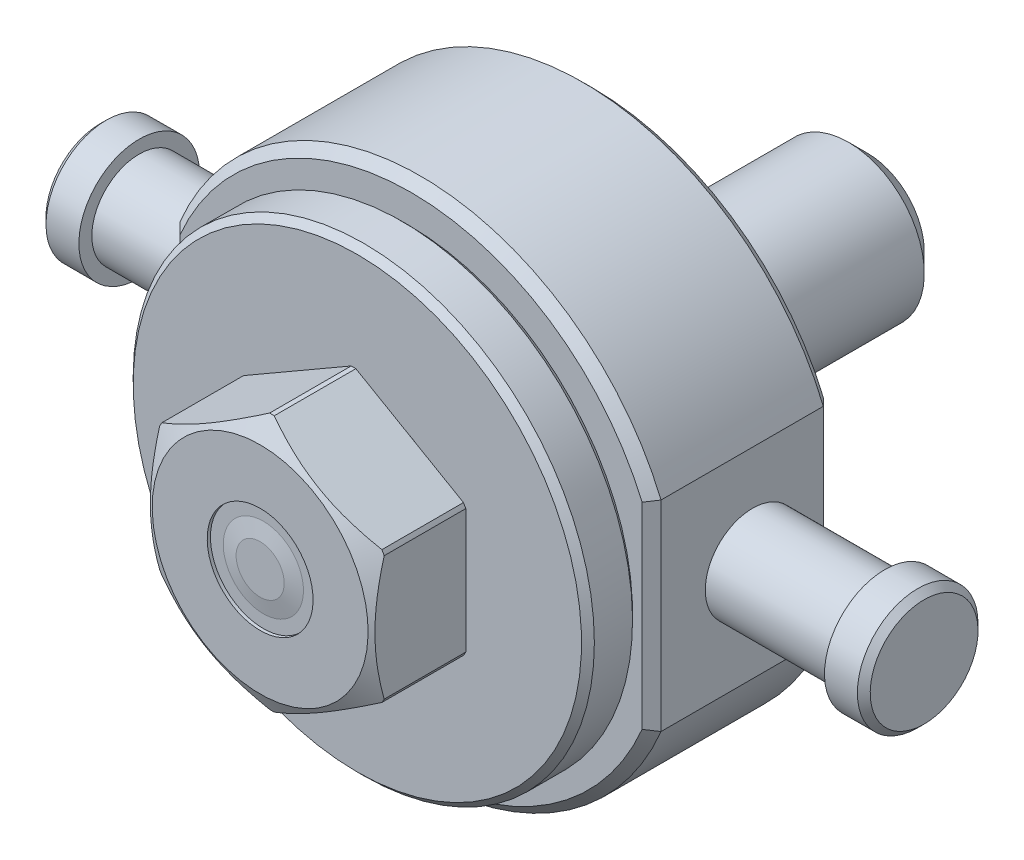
ISO-10303-21;
HEADER;
FILE_DESCRIPTION(('STEP AP214'),'2;1');
FILE_NAME('part.step','',(''),(''),'','','');
FILE_SCHEMA(('AUTOMOTIVE_DESIGN { 1 0 10303 214 1 1 1 1 }'));
ENDSEC;
DATA;
#1=APPLICATION_CONTEXT('core data for automotive mechanical design processes');
#2=APPLICATION_PROTOCOL_DEFINITION('international standard','automotive_design',2000,#1);
#3=PRODUCT_CONTEXT('',#1,'mechanical');
#4=PRODUCT('Part','Part','',(#3));
#5=PRODUCT_RELATED_PRODUCT_CATEGORY('part','',(#4));
#6=PRODUCT_DEFINITION_FORMATION('','',#4);
#7=PRODUCT_DEFINITION_CONTEXT('part definition',#1,'design');
#8=PRODUCT_DEFINITION('design','',#6,#7);
#9=PRODUCT_DEFINITION_SHAPE('','',#8);
#10=(LENGTH_UNIT() NAMED_UNIT(*) SI_UNIT(.MILLI.,.METRE.));
#11=(NAMED_UNIT(*) PLANE_ANGLE_UNIT() SI_UNIT($,.RADIAN.));
#12=(NAMED_UNIT(*) SI_UNIT($,.STERADIAN.) SOLID_ANGLE_UNIT());
#13=UNCERTAINTY_MEASURE_WITH_UNIT(LENGTH_MEASURE(1.E-05),#10,'distance_accuracy_value','');
#14=(GEOMETRIC_REPRESENTATION_CONTEXT(3) GLOBAL_UNCERTAINTY_ASSIGNED_CONTEXT((#13)) GLOBAL_UNIT_ASSIGNED_CONTEXT((#10,
#11,#12)) REPRESENTATION_CONTEXT('',''));
#15=CARTESIAN_POINT('',(0.,0.,0.));
#16=DIRECTION('',(0.,0.,1.));
#17=DIRECTION('',(1.,0.,0.));
#18=AXIS2_PLACEMENT_3D('',#15,#16,#17);
#19=CARTESIAN_POINT('',(-38.1,0.,59.4408015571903));
#20=DIRECTION('',(-1.,0.,0.));
#21=DIRECTION('',(0.,0.,1.));
#22=AXIS2_PLACEMENT_3D('',#19,#20,#21);
#23=PLANE('',#22);
#24=DIRECTION('',(0.,0.,-1.));
#25=VECTOR('',#24,1.);
#26=CARTESIAN_POINT('',(-38.1,15.875,35.2806));
#27=LINE('',#26,#25);
#28=CARTESIAN_POINT('',(-38.1,15.875,8.0786));
#29=VERTEX_POINT('',#28);
#30=CARTESIAN_POINT('',(-38.1,15.875,33.7806));
#31=VERTEX_POINT('',#30);
#32=EDGE_CURVE('E243',#29,#31,#27,.F.);
#33=ORIENTED_EDGE('',*,*,#32,.F.);
#34=DIRECTION('',(0.,-1.,0.));
#35=VECTOR('',#34,1.);
#36=CARTESIAN_POINT('',(-38.1,-11.4210605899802,8.0786));
#37=LINE('',#36,#35);
#38=CARTESIAN_POINT('',(-38.1,-15.8750000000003,8.0786));
#39=VERTEX_POINT('',#38);
#40=EDGE_CURVE('E171',#29,#39,#37,.T.);
#41=ORIENTED_EDGE('',*,*,#40,.T.);
#42=DIRECTION('',(0.,0.,-1.));
#43=VECTOR('',#42,1.);
#44=CARTESIAN_POINT('',(-38.1,-15.875,35.2806));
#45=LINE('',#44,#43);
#46=CARTESIAN_POINT('',(-38.1,-15.875,33.7806));
#47=VERTEX_POINT('',#46);
#48=EDGE_CURVE('E186',#47,#39,#45,.T.);
#49=ORIENTED_EDGE('',*,*,#48,.F.);
#50=DIRECTION('',(0.,1.,0.));
#51=VECTOR('',#50,1.);
#52=CARTESIAN_POINT('',(-38.1,0.,33.7806));
#53=LINE('',#52,#51);
#54=EDGE_CURVE('E550',#47,#31,#53,.T.);
#55=ORIENTED_EDGE('',*,*,#54,.T.);
#56=EDGE_LOOP('',(#33,#41,#49,#55));
#57=FACE_BOUND('',#56,.T.);
#58=CARTESIAN_POINT('',(-38.1,0.,19.2786));
#59=DIRECTION('',(-1.,0.,0.));
#60=DIRECTION('',(0.,0.,1.));
#61=AXIS2_PLACEMENT_3D('',#58,#59,#60);
#62=CIRCLE('',#61,7.5);
#63=CARTESIAN_POINT('',(-38.1,0.,26.7786));
#64=VERTEX_POINT('',#63);
#65=EDGE_CURVE('E244',#64,#64,#62,.F.);
#66=ORIENTED_EDGE('',*,*,#65,.T.);
#67=EDGE_LOOP('',(#66));
#68=FACE_BOUND('',#67,.T.);
#69=ADVANCED_FACE('F14',(#57,#68),#23,.T.);
#70=CARTESIAN_POINT('',(38.1,0.,59.4408015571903));
#71=DIRECTION('',(1.,0.,0.));
#72=DIRECTION('',(0.,0.,-1.));
#73=AXIS2_PLACEMENT_3D('',#70,#71,#72);
#74=PLANE('',#73);
#75=DIRECTION('',(0.,0.,-1.));
#76=VECTOR('',#75,1.);
#77=CARTESIAN_POINT('',(38.1,-15.875,35.2806));
#78=LINE('',#77,#76);
#79=CARTESIAN_POINT('',(38.1,-15.875,8.0786));
#80=VERTEX_POINT('',#79);
#81=CARTESIAN_POINT('',(38.1,-15.875,33.7806));
#82=VERTEX_POINT('',#81);
#83=EDGE_CURVE('E176',#80,#82,#78,.F.);
#84=ORIENTED_EDGE('',*,*,#83,.F.);
#85=DIRECTION('',(0.,1.,0.));
#86=VECTOR('',#85,1.);
#87=CARTESIAN_POINT('',(38.1,11.4210605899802,8.0786));
#88=LINE('',#87,#86);
#89=CARTESIAN_POINT('',(38.1,15.875,8.0786));
#90=VERTEX_POINT('',#89);
#91=EDGE_CURVE('E180',#80,#90,#88,.T.);
#92=ORIENTED_EDGE('',*,*,#91,.T.);
#93=DIRECTION('',(0.,0.,-1.));
#94=VECTOR('',#93,1.);
#95=CARTESIAN_POINT('',(38.1,15.875,35.2806));
#96=LINE('',#95,#94);
#97=CARTESIAN_POINT('',(38.1,15.875,33.7806));
#98=VERTEX_POINT('',#97);
#99=EDGE_CURVE('E239',#98,#90,#96,.T.);
#100=ORIENTED_EDGE('',*,*,#99,.F.);
#101=DIRECTION('',(0.,-1.,0.));
#102=VECTOR('',#101,1.);
#103=CARTESIAN_POINT('',(38.1,0.,33.7806));
#104=LINE('',#103,#102);
#105=EDGE_CURVE('E182',#98,#82,#104,.T.);
#106=ORIENTED_EDGE('',*,*,#105,.T.);
#107=EDGE_LOOP('',(#84,#92,#100,#106));
#108=FACE_BOUND('',#107,.T.);
#109=CARTESIAN_POINT('',(38.1,0.,19.2786));
#110=DIRECTION('',(1.,0.,0.));
#111=DIRECTION('',(0.,0.,-1.));
#112=AXIS2_PLACEMENT_3D('',#109,#110,#111);
#113=CIRCLE('',#112,7.5);
#114=CARTESIAN_POINT('',(38.1,0.,11.7786));
#115=VERTEX_POINT('',#114);
#116=EDGE_CURVE('E500',#115,#115,#113,.F.);
#117=ORIENTED_EDGE('',*,*,#116,.T.);
#118=EDGE_LOOP('',(#117));
#119=FACE_BOUND('',#118,.T.);
#120=ADVANCED_FACE('F177',(#108,#119),#74,.T.);
#121=CARTESIAN_POINT('',(0.,0.,35.2806));
#122=DIRECTION('',(0.,0.,1.));
#123=DIRECTION('',(0.,-1.,0.));
#124=AXIS2_PLACEMENT_3D('',#121,#122,#123);
#125=PLANE('',#124);
#126=CARTESIAN_POINT('',(0.,0.,35.2806));
#127=DIRECTION('',(0.,0.,-1.));
#128=DIRECTION('',(1.,0.,0.));
#129=AXIS2_PLACEMENT_3D('',#126,#127,#128);
#130=CIRCLE('',#129,18.7198);
#131=CARTESIAN_POINT('',(18.7198,0.,35.2806));
#132=VERTEX_POINT('',#131);
#133=EDGE_CURVE('E372',#132,#132,#130,.T.);
#134=ORIENTED_EDGE('',*,*,#133,.T.);
#135=EDGE_LOOP('',(#134));
#136=FACE_BOUND('',#135,.T.);
#137=CARTESIAN_POINT('',(0.,0.,35.2806));
#138=DIRECTION('',(0.,0.,1.));
#139=DIRECTION('',(1.,0.,0.));
#140=AXIS2_PLACEMENT_3D('',#137,#138,#139);
#141=CIRCLE('',#140,39.775);
#142=CARTESIAN_POINT('',(-36.6,-15.5721104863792,35.2806));
#143=VERTEX_POINT('',#142);
#144=CARTESIAN_POINT('',(36.6,-15.5721104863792,35.2806));
#145=VERTEX_POINT('',#144);
#146=EDGE_CURVE('E253',#143,#145,#141,.T.);
#147=ORIENTED_EDGE('',*,*,#146,.T.);
#148=DIRECTION('',(0.,1.,0.));
#149=VECTOR('',#148,1.);
#150=CARTESIAN_POINT('',(36.6,0.,35.2806));
#151=LINE('',#150,#149);
#152=CARTESIAN_POINT('',(36.6,15.5721104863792,35.2806));
#153=VERTEX_POINT('',#152);
#154=EDGE_CURVE('E199',#145,#153,#151,.T.);
#155=ORIENTED_EDGE('',*,*,#154,.T.);
#156=CARTESIAN_POINT('',(-36.6,15.5721104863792,35.2806));
#157=VERTEX_POINT('',#156);
#158=EDGE_CURVE('E238',#153,#157,#141,.T.);
#159=ORIENTED_EDGE('',*,*,#158,.T.);
#160=DIRECTION('',(0.,-1.,0.));
#161=VECTOR('',#160,1.);
#162=CARTESIAN_POINT('',(-36.6,0.,35.2806));
#163=LINE('',#162,#161);
#164=EDGE_CURVE('E196',#157,#143,#163,.T.);
#165=ORIENTED_EDGE('',*,*,#164,.T.);
#166=EDGE_LOOP('',(#147,#155,#159,#165));
#167=FACE_BOUND('',#166,.T.);
#168=ADVANCED_FACE('F255',(#136,#167),#125,.T.);
#169=CARTESIAN_POINT('',(0.,0.,33.7806));
#170=DIRECTION('',(0.,0.,-1.));
#171=DIRECTION('',(-1.,0.,0.));
#172=AXIS2_PLACEMENT_3D('',#169,#170,#171);
#173=CONICAL_SURFACE('',#172,41.275,0.785398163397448);
#174=CARTESIAN_POINT('',(0.,0.,33.7806));
#175=DIRECTION('',(0.,0.,1.));
#176=DIRECTION('',(1.,0.,0.));
#177=AXIS2_PLACEMENT_3D('',#174,#175,#176);
#178=CIRCLE('',#177,41.275);
#179=EDGE_CURVE('E248',#47,#82,#178,.T.);
#180=ORIENTED_EDGE('',*,*,#179,.T.);
#181=CARTESIAN_POINT('',(38.1,-15.875,33.7806));
#182=CARTESIAN_POINT('',(37.8499518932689,-15.8249949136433,34.0306481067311));
#183=CARTESIAN_POINT('',(37.5999278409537,-15.7747515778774,34.2806721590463));
#184=CARTESIAN_POINT('',(37.0999278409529,-15.6737884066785,34.7806721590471));
#185=CARTESIAN_POINT('',(36.8499518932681,-15.6230685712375,35.0306481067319));
#186=CARTESIAN_POINT('',(36.6,-15.5721104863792,35.2806));
#187=B_SPLINE_CURVE_WITH_KNOTS('',3,(#181,#182,#183,#184,#185,#186),.UNSPECIFIED.,.F.,.F.,(4,2,
4),(0.,1.0714177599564,2.1428355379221),.UNSPECIFIED.);
#188=EDGE_CURVE('E9',#82,#145,#187,.T.);
#189=ORIENTED_EDGE('',*,*,#188,.T.);
#190=ORIENTED_EDGE('',*,*,#146,.F.);
#191=CARTESIAN_POINT('',(-36.6,-15.5721104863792,35.2806));
#192=CARTESIAN_POINT('',(-36.8499518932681,-15.6230685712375,35.0306481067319));
#193=CARTESIAN_POINT('',(-37.0999278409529,-15.6737884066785,34.7806721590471));
#194=CARTESIAN_POINT('',(-37.5999278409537,-15.7747515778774,34.2806721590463));
#195=CARTESIAN_POINT('',(-37.8499518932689,-15.8249949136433,34.0306481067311));
#196=CARTESIAN_POINT('',(-38.1,-15.875,33.7806));
#197=B_SPLINE_CURVE_WITH_KNOTS('',3,(#191,#192,#193,#194,#195,#196),.UNSPECIFIED.,.F.,.F.,(4,2,
4),(0.,1.07141777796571,2.1428355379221),.UNSPECIFIED.);
#198=EDGE_CURVE('E28',#143,#47,#197,.T.);
#199=ORIENTED_EDGE('',*,*,#198,.T.);
#200=EDGE_LOOP('',(#180,#189,#190,#199));
#201=FACE_BOUND('',#200,.T.);
#202=ADVANCED_FACE('F222',(#201),#173,.T.);
#203=CARTESIAN_POINT('',(0.,0.,6.5786));
#204=DIRECTION('',(0.,0.,1.));
#205=DIRECTION('',(1.,0.,0.));
#206=AXIS2_PLACEMENT_3D('',#203,#204,#205);
#207=CONICAL_SURFACE('',#206,39.775,0.785398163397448);
#208=CARTESIAN_POINT('',(0.,0.,8.0786));
#209=DIRECTION('',(0.,0.,1.));
#210=DIRECTION('',(1.,0.,0.));
#211=AXIS2_PLACEMENT_3D('',#208,#209,#210);
#212=CIRCLE('',#211,41.275);
#213=EDGE_CURVE('E164',#39,#80,#212,.T.);
#214=ORIENTED_EDGE('',*,*,#213,.F.);
#215=CARTESIAN_POINT('',(-38.1,-15.8750000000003,8.0786));
#216=CARTESIAN_POINT('',(-37.8499518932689,-15.8249949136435,7.82855189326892));
#217=CARTESIAN_POINT('',(-37.5999278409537,-15.7747515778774,7.57852784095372));
#218=CARTESIAN_POINT('',(-37.0999278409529,-15.6737884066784,7.07852784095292));
#219=CARTESIAN_POINT('',(-36.8499518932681,-15.6230685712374,6.82855189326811));
#220=CARTESIAN_POINT('',(-36.6,-15.5721104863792,6.5786));
#221=B_SPLINE_CURVE_WITH_KNOTS('',3,(#215,#216,#217,#218,#219,#220),.UNSPECIFIED.,.F.,.F.,(4,2,
4),(0.,1.07141775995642,2.14283553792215),.UNSPECIFIED.);
#222=CARTESIAN_POINT('',(-36.6,-15.5721104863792,6.5786));
#223=VERTEX_POINT('',#222);
#224=EDGE_CURVE('E170',#39,#223,#221,.T.);
#225=ORIENTED_EDGE('',*,*,#224,.T.);
#226=CARTESIAN_POINT('',(0.,0.,6.5786));
#227=DIRECTION('',(0.,0.,1.));
#228=DIRECTION('',(1.,0.,0.));
#229=AXIS2_PLACEMENT_3D('',#226,#227,#228);
#230=CIRCLE('',#229,39.775);
#231=CARTESIAN_POINT('',(36.6,-15.5721104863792,6.5786));
#232=VERTEX_POINT('',#231);
#233=EDGE_CURVE('E166',#223,#232,#230,.T.);
#234=ORIENTED_EDGE('',*,*,#233,.T.);
#235=CARTESIAN_POINT('',(36.6,-15.5721104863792,6.5786));
#236=CARTESIAN_POINT('',(36.8499518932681,-15.6230685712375,6.8285518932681));
#237=CARTESIAN_POINT('',(37.0999278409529,-15.6737884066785,7.0785278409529));
#238=CARTESIAN_POINT('',(37.5999278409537,-15.7747515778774,7.57852784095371));
#239=CARTESIAN_POINT('',(37.8499518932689,-15.8249949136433,7.82855189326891));
#240=CARTESIAN_POINT('',(38.1,-15.875,8.0786));
#241=B_SPLINE_CURVE_WITH_KNOTS('',3,(#235,#236,#237,#238,#239,#240),.UNSPECIFIED.,.F.,.F.,(4,2,
4),(0.,1.07141777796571,2.14283553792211),.UNSPECIFIED.);
#242=EDGE_CURVE('E160',#232,#80,#241,.T.);
#243=ORIENTED_EDGE('',*,*,#242,.T.);
#244=EDGE_LOOP('',(#214,#225,#234,#243));
#245=FACE_BOUND('',#244,.T.);
#246=ADVANCED_FACE('F162',(#245),#207,.T.);
#247=CARTESIAN_POINT('',(0.,0.,35.2806));
#248=DIRECTION('',(0.,0.,-1.));
#249=DIRECTION('',(0.,1.,0.));
#250=AXIS2_PLACEMENT_3D('',#247,#248,#249);
#251=CYLINDRICAL_SURFACE('',#250,41.275);
#252=ORIENTED_EDGE('',*,*,#213,.T.);
#253=ORIENTED_EDGE('',*,*,#83,.T.);
#254=ORIENTED_EDGE('',*,*,#179,.F.);
#255=ORIENTED_EDGE('',*,*,#48,.T.);
#256=EDGE_LOOP('',(#252,#253,#254,#255));
#257=FACE_BOUND('',#256,.T.);
#258=ADVANCED_FACE('F189',(#257),#251,.T.);
#259=CARTESIAN_POINT('',(0.,0.,6.5786));
#260=DIRECTION('',(0.,0.,1.));
#261=DIRECTION('',(0.,-1.,0.));
#262=AXIS2_PLACEMENT_3D('',#259,#260,#261);
#263=PLANE('',#262);
#264=CARTESIAN_POINT('',(0.,0.,6.5786));
#265=DIRECTION('',(0.,0.,-1.));
#266=DIRECTION('',(0.,1.,0.));
#267=AXIS2_PLACEMENT_3D('',#264,#265,#266);
#268=CIRCLE('',#267,28.829);
#269=CARTESIAN_POINT('',(0.,28.829,6.5786));
#270=VERTEX_POINT('',#269);
#271=EDGE_CURVE('E273',#270,#270,#268,.T.);
#272=ORIENTED_EDGE('',*,*,#271,.F.);
#273=EDGE_LOOP('',(#272));
#274=FACE_BOUND('',#273,.T.);
#275=ORIENTED_EDGE('',*,*,#233,.F.);
#276=DIRECTION('',(0.,1.,0.));
#277=VECTOR('',#276,1.);
#278=CARTESIAN_POINT('',(-36.6,11.4210605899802,6.5786));
#279=LINE('',#278,#277);
#280=CARTESIAN_POINT('',(-36.6,15.5721104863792,6.5786));
#281=VERTEX_POINT('',#280);
#282=EDGE_CURVE('E514',#223,#281,#279,.T.);
#283=ORIENTED_EDGE('',*,*,#282,.T.);
#284=CARTESIAN_POINT('',(36.6,15.5721104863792,6.5786));
#285=VERTEX_POINT('',#284);
#286=EDGE_CURVE('E507',#285,#281,#230,.T.);
#287=ORIENTED_EDGE('',*,*,#286,.F.);
#288=DIRECTION('',(0.,-1.,0.));
#289=VECTOR('',#288,1.);
#290=CARTESIAN_POINT('',(36.6,-11.4210605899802,6.5786));
#291=LINE('',#290,#289);
#292=EDGE_CURVE('E542',#285,#232,#291,.T.);
#293=ORIENTED_EDGE('',*,*,#292,.T.);
#294=EDGE_LOOP('',(#275,#283,#287,#293));
#295=FACE_BOUND('',#294,.T.);
#296=ADVANCED_FACE('F549',(#274,#295),#263,.F.);
#297=CARTESIAN_POINT('',(-86.4658034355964,0.,19.2786));
#298=DIRECTION('',(1.,0.,0.));
#299=DIRECTION('',(0.,1.,0.));
#300=AXIS2_PLACEMENT_3D('',#297,#298,#299);
#301=CYLINDRICAL_SURFACE('',#300,7.5);
#302=ORIENTED_EDGE('',*,*,#116,.F.);
#303=EDGE_LOOP('',(#302));
#304=FACE_BOUND('',#303,.T.);
#305=CARTESIAN_POINT('',(59.0296,0.,19.2786));
#306=DIRECTION('',(-1.,0.,0.));
#307=DIRECTION('',(0.,-1.,0.));
#308=AXIS2_PLACEMENT_3D('',#305,#306,#307);
#309=CIRCLE('',#308,7.5);
#310=CARTESIAN_POINT('',(59.0296,-7.5,19.2786));
#311=VERTEX_POINT('',#310);
#312=EDGE_CURVE('E260',#311,#311,#309,.T.);
#313=ORIENTED_EDGE('',*,*,#312,.T.);
#314=EDGE_LOOP('',(#313));
#315=FACE_BOUND('',#314,.T.);
#316=ADVANCED_FACE('F671',(#304,#315),#301,.T.);
#317=CARTESIAN_POINT('',(-59.0296,0.,19.2786));
#318=DIRECTION('',(1.,0.,0.));
#319=DIRECTION('',(0.,1.,0.));
#320=AXIS2_PLACEMENT_3D('',#317,#318,#319);
#321=CIRCLE('',#320,7.5);
#322=CARTESIAN_POINT('',(-59.0296,7.5,19.2786));
#323=VERTEX_POINT('',#322);
#324=EDGE_CURVE('E265',#323,#323,#321,.T.);
#325=ORIENTED_EDGE('',*,*,#324,.T.);
#326=EDGE_LOOP('',(#325));
#327=FACE_BOUND('',#326,.T.);
#328=ORIENTED_EDGE('',*,*,#65,.F.);
#329=EDGE_LOOP('',(#328));
#330=FACE_BOUND('',#329,.T.);
#331=ADVANCED_FACE('F221',(#327,#330),#301,.T.);
#332=ORIENTED_EDGE('',*,*,#158,.F.);
#333=CARTESIAN_POINT('',(36.6,15.5721104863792,35.2806));
#334=CARTESIAN_POINT('',(36.8499518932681,15.6230685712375,35.0306481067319));
#335=CARTESIAN_POINT('',(37.0999278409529,15.6737884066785,34.7806721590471));
#336=CARTESIAN_POINT('',(37.5999278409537,15.7747515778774,34.2806721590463));
#337=CARTESIAN_POINT('',(37.8499518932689,15.8249949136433,34.0306481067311));
#338=CARTESIAN_POINT('',(38.1,15.875,33.7806));
#339=B_SPLINE_CURVE_WITH_KNOTS('',3,(#333,#334,#335,#336,#337,#338),.UNSPECIFIED.,.F.,.F.,(4,2,
4),(0.,1.07141777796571,2.1428355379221),.UNSPECIFIED.);
#340=EDGE_CURVE('E43',#153,#98,#339,.T.);
#341=ORIENTED_EDGE('',*,*,#340,.T.);
#342=EDGE_CURVE('E191',#98,#31,#178,.T.);
#343=ORIENTED_EDGE('',*,*,#342,.T.);
#344=CARTESIAN_POINT('',(-38.1,15.875,33.7806));
#345=CARTESIAN_POINT('',(-37.8499518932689,15.8249949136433,34.0306481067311));
#346=CARTESIAN_POINT('',(-37.5999278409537,15.7747515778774,34.2806721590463));
#347=CARTESIAN_POINT('',(-37.0999278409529,15.6737884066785,34.7806721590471));
#348=CARTESIAN_POINT('',(-36.8499518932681,15.6230685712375,35.0306481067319));
#349=CARTESIAN_POINT('',(-36.6,15.5721104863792,35.2806));
#350=B_SPLINE_CURVE_WITH_KNOTS('',3,(#344,#345,#346,#347,#348,#349),.UNSPECIFIED.,.F.,.F.,(4,2,
4),(0.,1.0714177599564,2.1428355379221),.UNSPECIFIED.);
#351=EDGE_CURVE('E35',#31,#157,#350,.T.);
#352=ORIENTED_EDGE('',*,*,#351,.T.);
#353=EDGE_LOOP('',(#332,#341,#343,#352));
#354=FACE_BOUND('',#353,.T.);
#355=ADVANCED_FACE('F215',(#354),#173,.T.);
#356=ORIENTED_EDGE('',*,*,#286,.T.);
#357=CARTESIAN_POINT('',(-36.6,15.5721104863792,6.5786));
#358=CARTESIAN_POINT('',(-36.8499518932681,15.6230685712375,6.8285518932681));
#359=CARTESIAN_POINT('',(-37.0999278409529,15.6737884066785,7.0785278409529));
#360=CARTESIAN_POINT('',(-37.5999278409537,15.7747515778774,7.57852784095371));
#361=CARTESIAN_POINT('',(-37.8499518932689,15.8249949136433,7.82855189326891));
#362=CARTESIAN_POINT('',(-38.1,15.875,8.0786));
#363=B_SPLINE_CURVE_WITH_KNOTS('',3,(#357,#358,#359,#360,#361,#362),.UNSPECIFIED.,.F.,.F.,(4,2,
4),(0.,1.07141777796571,2.14283553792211),.UNSPECIFIED.);
#364=EDGE_CURVE('E201',#281,#29,#363,.T.);
#365=ORIENTED_EDGE('',*,*,#364,.T.);
#366=EDGE_CURVE('E192',#90,#29,#212,.T.);
#367=ORIENTED_EDGE('',*,*,#366,.F.);
#368=CARTESIAN_POINT('',(38.1,15.875,8.0786));
#369=CARTESIAN_POINT('',(37.8499518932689,15.8249949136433,7.82855189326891));
#370=CARTESIAN_POINT('',(37.5999278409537,15.7747515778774,7.57852784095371));
#371=CARTESIAN_POINT('',(37.0999278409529,15.6737884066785,7.0785278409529));
#372=CARTESIAN_POINT('',(36.8499518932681,15.6230685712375,6.8285518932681));
#373=CARTESIAN_POINT('',(36.6,15.5721104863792,6.5786));
#374=B_SPLINE_CURVE_WITH_KNOTS('',3,(#368,#369,#370,#371,#372,#373),.UNSPECIFIED.,.F.,.F.,(4,2,
4),(0.,1.0714177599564,2.14283553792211),.UNSPECIFIED.);
#375=EDGE_CURVE('E195',#90,#285,#374,.T.);
#376=ORIENTED_EDGE('',*,*,#375,.T.);
#377=EDGE_LOOP('',(#356,#365,#367,#376));
#378=FACE_BOUND('',#377,.T.);
#379=ADVANCED_FACE('F220',(#378),#207,.T.);
#380=ORIENTED_EDGE('',*,*,#342,.F.);
#381=ORIENTED_EDGE('',*,*,#99,.T.);
#382=ORIENTED_EDGE('',*,*,#366,.T.);
#383=ORIENTED_EDGE('',*,*,#32,.T.);
#384=EDGE_LOOP('',(#380,#381,#382,#383));
#385=FACE_BOUND('',#384,.T.);
#386=ADVANCED_FACE('F246',(#385),#251,.T.);
#387=CARTESIAN_POINT('',(0.,-17.0942,59.1566));
#388=DIRECTION('',(0.,0.,-1.));
#389=DIRECTION('',(0.,1.,0.));
#390=AXIS2_PLACEMENT_3D('',#387,#388,#389);
#391=PLANE('',#390);
#392=CARTESIAN_POINT('',(0.,0.,59.1566000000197));
#393=DIRECTION('',(0.,0.,-1.));
#394=DIRECTION('',(0.,1.,0.));
#395=AXIS2_PLACEMENT_3D('',#392,#393,#394);
#396=CIRCLE('',#395,3.80999999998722);
#397=CARTESIAN_POINT('',(0.,3.80999999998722,59.1566000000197));
#398=VERTEX_POINT('',#397);
#399=EDGE_CURVE('E268',#398,#398,#396,.T.);
#400=ORIENTED_EDGE('',*,*,#399,.F.);
#401=EDGE_LOOP('',(#400));
#402=FACE_BOUND('',#401,.T.);
#403=ADVANCED_FACE('F474',(#402),#391,.F.);
#404=CARTESIAN_POINT('',(0.,0.,58.6486000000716));
#405=DIRECTION('',(0.,0.,-1.));
#406=DIRECTION('',(0.,1.,0.));
#407=AXIS2_PLACEMENT_3D('',#404,#405,#406);
#408=CONICAL_SURFACE('',#407,6.34999999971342,1.37340076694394);
#409=ORIENTED_EDGE('',*,*,#399,.T.);
#410=EDGE_LOOP('',(#409));
#411=FACE_BOUND('',#410,.T.);
#412=CARTESIAN_POINT('',(0.,0.,58.6486000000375));
#413=DIRECTION('',(0.,0.,-1.));
#414=DIRECTION('',(0.,1.,0.));
#415=AXIS2_PLACEMENT_3D('',#412,#413,#414);
#416=CIRCLE('',#415,6.34999999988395);
#417=CARTESIAN_POINT('',(0.,6.34999999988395,58.6486000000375));
#418=VERTEX_POINT('',#417);
#419=EDGE_CURVE('E560',#418,#418,#416,.T.);
#420=ORIENTED_EDGE('',*,*,#419,.F.);
#421=EDGE_LOOP('',(#420));
#422=FACE_BOUND('',#421,.T.);
#423=ADVANCED_FACE('F932',(#411,#422),#408,.T.);
#424=CARTESIAN_POINT('',(-6.35,0.,58.6486));
#425=DIRECTION('',(0.,0.,1.));
#426=DIRECTION('',(0.,-1.,0.));
#427=AXIS2_PLACEMENT_3D('',#424,#425,#426);
#428=PLANE('',#427);
#429=CARTESIAN_POINT('',(0.,0.,58.6486));
#430=DIRECTION('',(0.,0.,-1.));
#431=DIRECTION('',(0.,1.,0.));
#432=AXIS2_PLACEMENT_3D('',#429,#430,#431);
#433=CIRCLE('',#432,8.382);
#434=CARTESIAN_POINT('',(0.,8.382,58.6486));
#435=VERTEX_POINT('',#434);
#436=EDGE_CURVE('E563',#435,#435,#433,.F.);
#437=ORIENTED_EDGE('',*,*,#436,.T.);
#438=EDGE_LOOP('',(#437));
#439=FACE_BOUND('',#438,.T.);
#440=ORIENTED_EDGE('',*,*,#419,.T.);
#441=EDGE_LOOP('',(#440));
#442=FACE_BOUND('',#441,.T.);
#443=ADVANCED_FACE('F923',(#439,#442),#428,.T.);
#444=CARTESIAN_POINT('',(0.,0.,3.5814));
#445=DIRECTION('',(0.,0.,-1.));
#446=DIRECTION('',(0.,1.,0.));
#447=AXIS2_PLACEMENT_3D('',#444,#445,#446);
#448=CYLINDRICAL_SURFACE('',#447,8.382);
#449=CARTESIAN_POINT('',(0.,0.,59.1566));
#450=DIRECTION('',(0.,0.,-1.));
#451=DIRECTION('',(0.,1.,0.));
#452=AXIS2_PLACEMENT_3D('',#449,#450,#451);
#453=CIRCLE('',#452,8.382);
#454=CARTESIAN_POINT('',(0.,8.382,59.1566));
#455=VERTEX_POINT('',#454);
#456=EDGE_CURVE('E566',#455,#455,#453,.F.);
#457=ORIENTED_EDGE('',*,*,#456,.T.);
#458=EDGE_LOOP('',(#457));
#459=FACE_BOUND('',#458,.T.);
#460=ORIENTED_EDGE('',*,*,#436,.F.);
#461=EDGE_LOOP('',(#460));
#462=FACE_BOUND('',#461,.T.);
#463=ADVANCED_FACE('F914',(#459,#462),#448,.F.);
#464=CARTESIAN_POINT('',(0.,-17.0942,59.1566));
#465=DIRECTION('',(0.,0.,-1.));
#466=DIRECTION('',(0.,1.,0.));
#467=AXIS2_PLACEMENT_3D('',#464,#465,#466);
#468=PLANE('',#467);
#469=ORIENTED_EDGE('',*,*,#456,.F.);
#470=EDGE_LOOP('',(#469));
#471=FACE_BOUND('',#470,.T.);
#472=CARTESIAN_POINT('',(0.,0.,59.1566));
#473=DIRECTION('',(0.,0.,-1.));
#474=DIRECTION('',(0.,1.,0.));
#475=AXIS2_PLACEMENT_3D('',#472,#473,#474);
#476=CIRCLE('',#475,17.0942);
#477=CARTESIAN_POINT('',(0.,17.0942,59.1566));
#478=VERTEX_POINT('',#477);
#479=EDGE_CURVE('E366',#478,#478,#476,.T.);
#480=ORIENTED_EDGE('',*,*,#479,.F.);
#481=EDGE_LOOP('',(#480));
#482=FACE_BOUND('',#481,.T.);
#483=ADVANCED_FACE('F886',(#471,#482),#468,.F.);
#484=CARTESIAN_POINT('',(0.,0.,113.691809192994));
#485=DIRECTION('',(0.,0.,1.));
#486=DIRECTION('',(0.,-1.,0.));
#487=AXIS2_PLACEMENT_3D('',#484,#485,#486);
#488=CYLINDRICAL_SURFACE('',#487,20.32);
#489=DIRECTION('',(0.,0.,1.));
#490=VECTOR('',#489,1.);
#491=CARTESIAN_POINT('',(0.370581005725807,20.3166205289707,-36.2458));
#492=LINE('',#491,#490);
#493=CARTESIAN_POINT('',(0.370581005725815,20.3166205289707,44.3738));
#494=VERTEX_POINT('',#493);
#495=CARTESIAN_POINT('',(0.370581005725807,20.3166205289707,57.2941835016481));
#496=VERTEX_POINT('',#495);
#497=EDGE_CURVE('E347',#494,#496,#492,.T.);
#498=ORIENTED_EDGE('',*,*,#497,.F.);
#499=CARTESIAN_POINT('',(0.,0.,44.3738));
#500=DIRECTION('',(0.,0.,1.));
#501=DIRECTION('',(0.,-1.,0.));
#502=AXIS2_PLACEMENT_3D('',#499,#500,#501);
#503=CIRCLE('',#502,20.32);
#504=CARTESIAN_POINT('',(-0.370581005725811,20.3166205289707,44.3738));
#505=VERTEX_POINT('',#504);
#506=EDGE_CURVE('E569',#494,#505,#503,.T.);
#507=ORIENTED_EDGE('',*,*,#506,.T.);
#508=DIRECTION('',(0.,0.,1.));
#509=VECTOR('',#508,1.);
#510=CARTESIAN_POINT('',(-0.3705810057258,20.3166205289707,-36.2458));
#511=LINE('',#510,#509);
#512=CARTESIAN_POINT('',(-0.370581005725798,20.3166205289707,57.2941835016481));
#513=VERTEX_POINT('',#512);
#514=EDGE_CURVE('E343',#513,#505,#511,.F.);
#515=ORIENTED_EDGE('',*,*,#514,.F.);
#516=CARTESIAN_POINT('',(0.,0.,57.2941835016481));
#517=DIRECTION('',(0.,0.,-1.));
#518=DIRECTION('',(1.,0.,0.));
#519=AXIS2_PLACEMENT_3D('',#516,#517,#518);
#520=CIRCLE('',#519,20.32);
#521=EDGE_CURVE('E369',#496,#513,#520,.F.);
#522=ORIENTED_EDGE('',*,*,#521,.F.);
#523=EDGE_LOOP('',(#498,#507,#515,#522));
#524=FACE_BOUND('',#523,.T.);
#525=ADVANCED_FACE('F590',(#524),#488,.T.);
#526=CARTESIAN_POINT('',(0.,0.,113.691809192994));
#527=DIRECTION('',(0.,0.,1.));
#528=DIRECTION('',(0.,-1.,0.));
#529=AXIS2_PLACEMENT_3D('',#526,#527,#528);
#530=CYLINDRICAL_SURFACE('',#529,20.32);
#531=DIRECTION('',(0.,0.,1.));
#532=VECTOR('',#531,1.);
#533=CARTESIAN_POINT('',(-17.4094189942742,10.4792428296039,-36.2458));
#534=LINE('',#533,#532);
#535=CARTESIAN_POINT('',(-17.4094189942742,10.4792428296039,44.3738));
#536=VERTEX_POINT('',#535);
#537=CARTESIAN_POINT('',(-17.4094189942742,10.4792428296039,57.2941835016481));
#538=VERTEX_POINT('',#537);
#539=EDGE_CURVE('E340',#536,#538,#534,.T.);
#540=ORIENTED_EDGE('',*,*,#539,.F.);
#541=CARTESIAN_POINT('',(0.,0.,44.3738));
#542=DIRECTION('',(0.,0.,1.));
#543=DIRECTION('',(0.,-1.,0.));
#544=AXIS2_PLACEMENT_3D('',#541,#542,#543);
#545=CIRCLE('',#544,20.32);
#546=CARTESIAN_POINT('',(-17.78,9.83737769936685,44.3738));
#547=VERTEX_POINT('',#546);
#548=EDGE_CURVE('E571',#536,#547,#545,.T.);
#549=ORIENTED_EDGE('',*,*,#548,.T.);
#550=DIRECTION('',(0.,0.,1.));
#551=VECTOR('',#550,1.);
#552=CARTESIAN_POINT('',(-17.78,9.83737769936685,-36.2458));
#553=LINE('',#552,#551);
#554=CARTESIAN_POINT('',(-17.78,9.83737769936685,57.2941835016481));
#555=VERTEX_POINT('',#554);
#556=EDGE_CURVE('E336',#555,#547,#553,.F.);
#557=ORIENTED_EDGE('',*,*,#556,.F.);
#558=CARTESIAN_POINT('',(0.,0.,57.2941835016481));
#559=DIRECTION('',(0.,0.,-1.));
#560=DIRECTION('',(1.,0.,0.));
#561=AXIS2_PLACEMENT_3D('',#558,#559,#560);
#562=CIRCLE('',#561,20.32);
#563=EDGE_CURVE('E367',#538,#555,#562,.F.);
#564=ORIENTED_EDGE('',*,*,#563,.F.);
#565=EDGE_LOOP('',(#540,#549,#557,#564));
#566=FACE_BOUND('',#565,.T.);
#567=ADVANCED_FACE('F619',(#566),#530,.T.);
#568=CARTESIAN_POINT('',(0.,0.,113.691809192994));
#569=DIRECTION('',(0.,0.,1.));
#570=DIRECTION('',(0.,-1.,0.));
#571=AXIS2_PLACEMENT_3D('',#568,#569,#570);
#572=CYLINDRICAL_SURFACE('',#571,20.32);
#573=DIRECTION('',(0.,0.,1.));
#574=VECTOR('',#573,1.);
#575=CARTESIAN_POINT('',(-17.78,-9.83737769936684,-36.2458));
#576=LINE('',#575,#574);
#577=CARTESIAN_POINT('',(-17.78,-9.83737769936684,44.3738));
#578=VERTEX_POINT('',#577);
#579=CARTESIAN_POINT('',(-17.78,-9.83737769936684,57.2941835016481));
#580=VERTEX_POINT('',#579);
#581=EDGE_CURVE('E333',#578,#580,#576,.T.);
#582=ORIENTED_EDGE('',*,*,#581,.F.);
#583=CARTESIAN_POINT('',(0.,0.,44.3738));
#584=DIRECTION('',(0.,0.,1.));
#585=DIRECTION('',(0.,-1.,0.));
#586=AXIS2_PLACEMENT_3D('',#583,#584,#585);
#587=CIRCLE('',#586,20.32);
#588=CARTESIAN_POINT('',(-17.4094189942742,-10.4792428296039,44.3738));
#589=VERTEX_POINT('',#588);
#590=EDGE_CURVE('E573',#578,#589,#587,.T.);
#591=ORIENTED_EDGE('',*,*,#590,.T.);
#592=DIRECTION('',(0.,0.,1.));
#593=VECTOR('',#592,1.);
#594=CARTESIAN_POINT('',(-17.4094189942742,-10.4792428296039,-36.2458));
#595=LINE('',#594,#593);
#596=CARTESIAN_POINT('',(-17.4094189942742,-10.4792428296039,57.2941835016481));
#597=VERTEX_POINT('',#596);
#598=EDGE_CURVE('E329',#597,#589,#595,.F.);
#599=ORIENTED_EDGE('',*,*,#598,.F.);
#600=CARTESIAN_POINT('',(0.,0.,57.2941835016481));
#601=DIRECTION('',(0.,0.,-1.));
#602=DIRECTION('',(1.,0.,0.));
#603=AXIS2_PLACEMENT_3D('',#600,#601,#602);
#604=CIRCLE('',#603,20.32);
#605=EDGE_CURVE('E364',#580,#597,#604,.F.);
#606=ORIENTED_EDGE('',*,*,#605,.F.);
#607=EDGE_LOOP('',(#582,#591,#599,#606));
#608=FACE_BOUND('',#607,.T.);
#609=ADVANCED_FACE('F612',(#608),#572,.T.);
#610=CARTESIAN_POINT('',(0.,0.,113.691809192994));
#611=DIRECTION('',(0.,0.,1.));
#612=DIRECTION('',(0.,-1.,0.));
#613=AXIS2_PLACEMENT_3D('',#610,#611,#612);
#614=CYLINDRICAL_SURFACE('',#613,20.32);
#615=DIRECTION('',(0.,0.,1.));
#616=VECTOR('',#615,1.);
#617=CARTESIAN_POINT('',(-0.370581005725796,-20.3166205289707,-36.2458));
#618=LINE('',#617,#616);
#619=CARTESIAN_POINT('',(-0.3705810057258,-20.3166205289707,44.3738));
#620=VERTEX_POINT('',#619);
#621=CARTESIAN_POINT('',(-0.370581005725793,-20.3166205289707,57.2941835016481));
#622=VERTEX_POINT('',#621);
#623=EDGE_CURVE('E326',#620,#622,#618,.T.);
#624=ORIENTED_EDGE('',*,*,#623,.F.);
#625=CARTESIAN_POINT('',(0.,0.,44.3738));
#626=DIRECTION('',(0.,0.,1.));
#627=DIRECTION('',(0.,-1.,0.));
#628=AXIS2_PLACEMENT_3D('',#625,#626,#627);
#629=CIRCLE('',#628,20.32);
#630=CARTESIAN_POINT('',(0.370581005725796,-20.3166205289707,44.3738));
#631=VERTEX_POINT('',#630);
#632=EDGE_CURVE('E371',#620,#631,#629,.T.);
#633=ORIENTED_EDGE('',*,*,#632,.T.);
#634=DIRECTION('',(0.,0.,1.));
#635=VECTOR('',#634,1.);
#636=CARTESIAN_POINT('',(0.370581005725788,-20.3166205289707,-36.2458));
#637=LINE('',#636,#635);
#638=CARTESIAN_POINT('',(0.370581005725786,-20.3166205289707,57.2941835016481));
#639=VERTEX_POINT('',#638);
#640=EDGE_CURVE('E322',#639,#631,#637,.F.);
#641=ORIENTED_EDGE('',*,*,#640,.F.);
#642=CARTESIAN_POINT('',(0.,0.,57.2941835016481));
#643=DIRECTION('',(0.,0.,-1.));
#644=DIRECTION('',(1.,0.,0.));
#645=AXIS2_PLACEMENT_3D('',#642,#643,#644);
#646=CIRCLE('',#645,20.32);
#647=EDGE_CURVE('E362',#622,#639,#646,.F.);
#648=ORIENTED_EDGE('',*,*,#647,.F.);
#649=EDGE_LOOP('',(#624,#633,#641,#648));
#650=FACE_BOUND('',#649,.T.);
#651=ADVANCED_FACE('F425',(#650),#614,.T.);
#652=CARTESIAN_POINT('',(0.,0.,57.2941835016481));
#653=DIRECTION('',(0.,0.,-1.));
#654=DIRECTION('',(0.,1.,0.));
#655=AXIS2_PLACEMENT_3D('',#652,#653,#654);
#656=CONICAL_SURFACE('',#655,20.32,1.0471975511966);
#657=CARTESIAN_POINT('',(-17.78,-9.83737769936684,57.2941835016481));
#658=CARTESIAN_POINT('',(-17.78,-9.43315140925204,57.4071538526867));
#659=CARTESIAN_POINT('',(-17.78,-9.02756699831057,57.5151978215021));
#660=CARTESIAN_POINT('',(-17.78,-8.21352291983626,57.7202515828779));
#661=CARTESIAN_POINT('',(-17.78,-7.8050626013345,57.8172587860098));
#662=CARTESIAN_POINT('',(-17.78,-6.57401527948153,58.0901860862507));
#663=CARTESIAN_POINT('',(-17.78,-5.74714127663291,58.2476179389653));
#664=CARTESIAN_POINT('',(-17.78,-4.50911513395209,58.4381097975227));
#665=CARTESIAN_POINT('',(-17.78,-4.10133060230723,58.4936246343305));
#666=CARTESIAN_POINT('',(-17.78,-3.28395955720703,58.589581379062));
#667=CARTESIAN_POINT('',(-17.78,-2.87437302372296,58.6300231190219));
#668=CARTESIAN_POINT('',(-17.78,-2.0543148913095,58.6950198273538));
#669=CARTESIAN_POINT('',(-17.78,-1.64384444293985,58.7195892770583));
#670=CARTESIAN_POINT('',(-17.78,-0.822249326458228,58.7524058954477));
#671=CARTESIAN_POINT('',(-17.78,-0.411124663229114,58.7606531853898));
#672=CARTESIAN_POINT('',(-17.78,0.411124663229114,58.7606531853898));
#673=CARTESIAN_POINT('',(-17.78,0.822249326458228,58.7524058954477));
#674=CARTESIAN_POINT('',(-17.78,1.64384444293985,58.7195892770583));
#675=CARTESIAN_POINT('',(-17.78,2.0543148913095,58.6950198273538));
#676=CARTESIAN_POINT('',(-17.78,2.87437302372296,58.6300231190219));
#677=CARTESIAN_POINT('',(-17.78,3.28395955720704,58.589581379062));
#678=CARTESIAN_POINT('',(-17.78,4.10133060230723,58.4936246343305));
#679=CARTESIAN_POINT('',(-17.78,4.50911513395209,58.4381097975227));
#680=CARTESIAN_POINT('',(-17.78,5.74714127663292,58.2476179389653));
#681=CARTESIAN_POINT('',(-17.78,6.57401527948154,58.0901860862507));
#682=CARTESIAN_POINT('',(-17.78,7.80506260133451,57.8172587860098));
#683=CARTESIAN_POINT('',(-17.78,8.21352291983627,57.7202515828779));
#684=CARTESIAN_POINT('',(-17.78,9.02756699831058,57.5151978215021));
#685=CARTESIAN_POINT('',(-17.78,9.43315140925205,57.4071538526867));
#686=CARTESIAN_POINT('',(-17.78,9.83737769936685,57.2941835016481));
#687=B_SPLINE_CURVE_WITH_KNOTS('',3,(#657,#658,#659,#660,#661,#662,#663,#664,#665,#666,#667,
#668,#669,#670,#671,#672,#673,#674,#675,#676,#677,#678,#679,#680,#681,#682,#683,#684,#685,#686),
.UNSPECIFIED.,.F.,.F.,(4,2,2,2,2,2,2,2,2,2,2,2,2,2,4),(0.,1.25906199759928,2.51841878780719,
5.04143015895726,6.27584524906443,7.51027409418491,8.74357509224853,9.97686692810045,
11.2101587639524,12.443459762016,13.6778886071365,14.9123036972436,17.4353150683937,
18.6946718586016,19.9537338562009),.UNSPECIFIED.);
#688=EDGE_CURVE('E339',#580,#555,#687,.T.);
#689=ORIENTED_EDGE('',*,*,#688,.F.);
#690=ORIENTED_EDGE('',*,*,#605,.T.);
#691=CARTESIAN_POINT('',(-0.370581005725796,-20.3166205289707,57.2941835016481));
#692=CARTESIAN_POINT('',(-0.758309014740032,-20.092765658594,57.4193151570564));
#693=CARTESIAN_POINT('',(-1.14754541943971,-19.8680399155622,57.5384082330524));
#694=CARTESIAN_POINT('',(-1.92909555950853,-19.4168117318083,57.7629038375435));
#695=CARTESIAN_POINT('',(-2.32141025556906,-19.1903087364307,57.8683018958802));
#696=CARTESIAN_POINT('',(-3.10974802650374,-18.7351617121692,58.0639146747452));
#697=CARTESIAN_POINT('',(-3.50577713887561,-18.5065141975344,58.1540971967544));
#698=CARTESIAN_POINT('',(-4.30044981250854,-18.0477097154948,58.3173270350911));
#699=CARTESIAN_POINT('',(-4.69909310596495,-17.8175529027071,58.3903760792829));
#700=CARTESIAN_POINT('',(-5.48917195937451,-17.3614006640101,58.5162983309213));
#701=CARTESIAN_POINT('',(-5.88055505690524,-17.1354355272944,58.5696077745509));
#702=CARTESIAN_POINT('',(-6.66493409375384,-16.6825740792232,58.6572325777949));
#703=CARTESIAN_POINT('',(-7.05793006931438,-16.4556777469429,58.691547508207));
#704=CARTESIAN_POINT('',(-7.84442005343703,-16.0015975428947,58.7403218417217));
#705=CARTESIAN_POINT('',(-8.23791304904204,-15.7744142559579,58.7548028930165));
#706=CARTESIAN_POINT('',(-9.02505935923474,-15.3199551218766,58.763610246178));
#707=CARTESIAN_POINT('',(-9.41871266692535,-15.092679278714,58.7579373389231));
#708=CARTESIAN_POINT('',(-10.1302970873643,-14.6818458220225,58.7295847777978));
#709=CARTESIAN_POINT('',(-10.4483356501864,-14.4982261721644,58.7103589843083));
#710=CARTESIAN_POINT('',(-11.0836575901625,-14.1314228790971,58.6591348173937));
#711=CARTESIAN_POINT('',(-11.4009409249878,-13.9482392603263,58.6271357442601));
#712=CARTESIAN_POINT('',(-12.03459368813,-13.5823996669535,58.5508361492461));
#713=CARTESIAN_POINT('',(-12.3509624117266,-13.3997440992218,58.506527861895));
#714=CARTESIAN_POINT('',(-12.9823222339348,-13.0352283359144,58.406266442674));
#715=CARTESIAN_POINT('',(-13.2973132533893,-12.85336818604,58.3503126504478));
#716=CARTESIAN_POINT('',(-14.25221998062,-12.3020525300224,58.1636769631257));
#717=CARTESIAN_POINT('',(-14.8896181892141,-11.9340505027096,58.015765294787));
#718=CARTESIAN_POINT('',(-16.1558810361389,-11.2029733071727,57.6818113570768));
#719=CARTESIAN_POINT('',(-16.7847574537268,-10.8398913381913,57.4958290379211));
#720=CARTESIAN_POINT('',(-17.4094189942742,-10.4792428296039,57.2941835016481));
#721=B_SPLINE_CURVE_WITH_KNOTS('',3,(#691,#692,#693,#694,#695,#696,#697,#698,#699,#700,#701,
#702,#703,#704,#705,#706,#707,#708,#709,#710,#711,#712,#713,#714,#715,#716,#717,#718,#719,#720),
.UNSPECIFIED.,.F.,.F.,(4,2,2,2,2,2,2,2,2,2,2,2,2,2,4),(0.,1.39463815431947,2.78973039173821,
4.18773881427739,5.58560619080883,6.95041938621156,8.31526341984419,9.67861656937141,
11.0419162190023,12.1449238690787,13.2479919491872,14.3517575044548,15.4555856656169,
17.7065418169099,19.9539802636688),.UNSPECIFIED.);
#722=EDGE_CURVE('E332',#622,#597,#721,.T.);
#723=ORIENTED_EDGE('',*,*,#722,.F.);
#724=ORIENTED_EDGE('',*,*,#647,.T.);
#725=CARTESIAN_POINT('',(17.4094189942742,-10.4792428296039,57.2941835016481));
#726=CARTESIAN_POINT('',(17.02169098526,-10.7030976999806,57.4193151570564));
#727=CARTESIAN_POINT('',(16.6324545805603,-10.9278234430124,57.5384082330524));
#728=CARTESIAN_POINT('',(15.8509044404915,-11.3790516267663,57.7629038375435));
#729=CARTESIAN_POINT('',(15.4585897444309,-11.6055546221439,57.8683018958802));
#730=CARTESIAN_POINT('',(14.6702519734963,-12.0607016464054,58.0639146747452));
#731=CARTESIAN_POINT('',(14.2742228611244,-12.2893491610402,58.1540971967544));
#732=CARTESIAN_POINT('',(13.4795501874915,-12.7481536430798,58.3173270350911));
#733=CARTESIAN_POINT('',(13.0809068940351,-12.9783104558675,58.3903760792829));
#734=CARTESIAN_POINT('',(12.2908280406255,-13.4344626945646,58.5162983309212));
#735=CARTESIAN_POINT('',(11.8994449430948,-13.6604278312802,58.5696077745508));
#736=CARTESIAN_POINT('',(11.1150659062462,-14.1132892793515,58.6572325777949));
#737=CARTESIAN_POINT('',(10.7220699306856,-14.3401856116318,58.691547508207));
#738=CARTESIAN_POINT('',(9.93557994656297,-14.7942658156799,58.7403218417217));
#739=CARTESIAN_POINT('',(9.54208695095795,-15.0214491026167,58.7548028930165));
#740=CARTESIAN_POINT('',(8.75494064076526,-15.4759082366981,58.763610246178));
#741=CARTESIAN_POINT('',(8.36128733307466,-15.7031840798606,58.7579373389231));
#742=CARTESIAN_POINT('',(7.64970291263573,-16.1140175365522,58.7295847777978));
#743=CARTESIAN_POINT('',(7.33166434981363,-16.2976371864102,58.7103589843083));
#744=CARTESIAN_POINT('',(6.69634240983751,-16.6644404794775,58.6591348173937));
#745=CARTESIAN_POINT('',(6.37905907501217,-16.8476240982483,58.6271357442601));
#746=CARTESIAN_POINT('',(5.74540631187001,-17.2134636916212,58.5508361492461));
#747=CARTESIAN_POINT('',(5.42903758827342,-17.3961192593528,58.506527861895));
#748=CARTESIAN_POINT('',(4.79767776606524,-17.7606350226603,58.406266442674));
#749=CARTESIAN_POINT('',(4.48268674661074,-17.9424951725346,58.3503126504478));
#750=CARTESIAN_POINT('',(3.52778001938,-18.4938108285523,58.1636769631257));
#751=CARTESIAN_POINT('',(2.89038181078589,-18.8618128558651,58.015765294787));
#752=CARTESIAN_POINT('',(1.62411896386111,-19.5928900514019,57.6818113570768));
#753=CARTESIAN_POINT('',(0.9952425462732,-19.9559720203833,57.4958290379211));
#754=CARTESIAN_POINT('',(0.37058100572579,-20.3166205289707,57.2941835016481));
#755=B_SPLINE_CURVE_WITH_KNOTS('',3,(#725,#726,#727,#728,#729,#730,#731,#732,#733,#734,#735,
#736,#737,#738,#739,#740,#741,#742,#743,#744,#745,#746,#747,#748,#749,#750,#751,#752,#753,#754),
.UNSPECIFIED.,.F.,.F.,(4,2,2,2,2,2,2,2,2,2,2,2,2,2,4),(0.,1.39463815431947,2.78973039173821,
4.18773881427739,5.58560619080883,6.95041938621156,8.31526341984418,9.67861656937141,
11.0419162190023,12.1449238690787,13.2479919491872,14.3517575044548,15.4555856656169,
17.70654181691,19.9539802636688),.UNSPECIFIED.);
#756=CARTESIAN_POINT('',(17.4094189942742,-10.4792428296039,57.2941835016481));
#757=VERTEX_POINT('',#756);
#758=EDGE_CURVE('E325',#757,#639,#755,.T.);
#759=ORIENTED_EDGE('',*,*,#758,.F.);
#760=CARTESIAN_POINT('',(0.,0.,57.2941835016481));
#761=DIRECTION('',(0.,0.,1.));
#762=DIRECTION('',(0.,-1.,0.));
#763=AXIS2_PLACEMENT_3D('',#760,#761,#762);
#764=CIRCLE('',#763,20.32);
#765=CARTESIAN_POINT('',(17.78,-9.83737769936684,57.2941835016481));
#766=VERTEX_POINT('',#765);
#767=EDGE_CURVE('E358',#766,#757,#764,.F.);
#768=ORIENTED_EDGE('',*,*,#767,.F.);
#769=CARTESIAN_POINT('',(17.78,9.83737769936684,57.2941835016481));
#770=CARTESIAN_POINT('',(17.78,9.43315140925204,57.4071538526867));
#771=CARTESIAN_POINT('',(17.78,9.02756699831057,57.5151978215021));
#772=CARTESIAN_POINT('',(17.78,8.21352291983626,57.7202515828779));
#773=CARTESIAN_POINT('',(17.78,7.8050626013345,57.8172587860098));
#774=CARTESIAN_POINT('',(17.78,6.57401527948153,58.0901860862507));
#775=CARTESIAN_POINT('',(17.78,5.74714127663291,58.2476179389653));
#776=CARTESIAN_POINT('',(17.78,4.50911513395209,58.4381097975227));
#777=CARTESIAN_POINT('',(17.78,4.10133060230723,58.4936246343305));
#778=CARTESIAN_POINT('',(17.78,3.28395955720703,58.589581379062));
#779=CARTESIAN_POINT('',(17.78,2.87437302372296,58.6300231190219));
#780=CARTESIAN_POINT('',(17.78,2.0543148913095,58.6950198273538));
#781=CARTESIAN_POINT('',(17.78,1.64384444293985,58.7195892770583));
#782=CARTESIAN_POINT('',(17.78,0.822249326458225,58.7524058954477));
#783=CARTESIAN_POINT('',(17.78,0.411124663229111,58.7606531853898));
#784=CARTESIAN_POINT('',(17.78,-0.411124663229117,58.7606531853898));
#785=CARTESIAN_POINT('',(17.78,-0.822249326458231,58.7524058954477));
#786=CARTESIAN_POINT('',(17.78,-1.64384444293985,58.7195892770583));
#787=CARTESIAN_POINT('',(17.78,-2.0543148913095,58.6950198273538));
#788=CARTESIAN_POINT('',(17.78,-2.87437302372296,58.6300231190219));
#789=CARTESIAN_POINT('',(17.78,-3.28395955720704,58.589581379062));
#790=CARTESIAN_POINT('',(17.78,-4.10133060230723,58.4936246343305));
#791=CARTESIAN_POINT('',(17.78,-4.50911513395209,58.4381097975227));
#792=CARTESIAN_POINT('',(17.78,-5.74714127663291,58.2476179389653));
#793=CARTESIAN_POINT('',(17.78,-6.57401527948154,58.0901860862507));
#794=CARTESIAN_POINT('',(17.78,-7.8050626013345,57.8172587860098));
#795=CARTESIAN_POINT('',(17.78,-8.21352291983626,57.7202515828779));
#796=CARTESIAN_POINT('',(17.78,-9.02756699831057,57.5151978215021));
#797=CARTESIAN_POINT('',(17.78,-9.43315140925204,57.4071538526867));
#798=CARTESIAN_POINT('',(17.78,-9.83737769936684,57.2941835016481));
#799=B_SPLINE_CURVE_WITH_KNOTS('',3,(#769,#770,#771,#772,#773,#774,#775,#776,#777,#778,#779,
#780,#781,#782,#783,#784,#785,#786,#787,#788,#789,#790,#791,#792,#793,#794,#795,#796,#797,#798),
.UNSPECIFIED.,.F.,.F.,(4,2,2,2,2,2,2,2,2,2,2,2,2,2,4),(0.,1.25906199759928,2.51841878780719,
5.04143015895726,6.27584524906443,7.51027409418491,8.74357509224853,9.97686692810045,
11.2101587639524,12.443459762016,13.6778886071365,14.9123036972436,17.4353150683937,
18.6946718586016,19.9537338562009),.UNSPECIFIED.);
#800=CARTESIAN_POINT('',(17.78,9.83737769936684,57.2941835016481));
#801=VERTEX_POINT('',#800);
#802=EDGE_CURVE('E318',#801,#766,#799,.T.);
#803=ORIENTED_EDGE('',*,*,#802,.F.);
#804=CARTESIAN_POINT('',(0.,0.,57.2941835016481));
#805=DIRECTION('',(0.,0.,1.));
#806=DIRECTION('',(0.,-1.,0.));
#807=AXIS2_PLACEMENT_3D('',#804,#805,#806);
#808=CIRCLE('',#807,20.32);
#809=CARTESIAN_POINT('',(17.4094189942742,10.4792428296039,57.2941835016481));
#810=VERTEX_POINT('',#809);
#811=EDGE_CURVE('E354',#810,#801,#808,.F.);
#812=ORIENTED_EDGE('',*,*,#811,.F.);
#813=CARTESIAN_POINT('',(0.370581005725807,20.3166205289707,57.2941835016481));
#814=CARTESIAN_POINT('',(0.758309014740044,20.092765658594,57.4193151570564));
#815=CARTESIAN_POINT('',(1.14754541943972,19.8680399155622,57.5384082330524));
#816=CARTESIAN_POINT('',(1.92909555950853,19.4168117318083,57.7629038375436));
#817=CARTESIAN_POINT('',(2.32141025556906,19.1903087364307,57.8683018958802));
#818=CARTESIAN_POINT('',(3.10974802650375,18.7351617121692,58.0639146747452));
#819=CARTESIAN_POINT('',(3.50577713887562,18.5065141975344,58.1540971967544));
#820=CARTESIAN_POINT('',(4.30044981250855,18.0477097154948,58.3173270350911));
#821=CARTESIAN_POINT('',(4.69909310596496,17.8175529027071,58.3903760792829));
#822=CARTESIAN_POINT('',(5.48917195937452,17.3614006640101,58.5162983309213));
#823=CARTESIAN_POINT('',(5.88055505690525,17.1354355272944,58.5696077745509));
#824=CARTESIAN_POINT('',(6.66493409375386,16.6825740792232,58.6572325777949));
#825=CARTESIAN_POINT('',(7.05793006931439,16.4556777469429,58.691547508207));
#826=CARTESIAN_POINT('',(7.84442005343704,16.0015975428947,58.7403218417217));
#827=CARTESIAN_POINT('',(8.23791304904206,15.7744142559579,58.7548028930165));
#828=CARTESIAN_POINT('',(9.02505935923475,15.3199551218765,58.763610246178));
#829=CARTESIAN_POINT('',(9.41871266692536,15.092679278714,58.7579373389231));
#830=CARTESIAN_POINT('',(10.1302970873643,14.6818458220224,58.7295847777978));
#831=CARTESIAN_POINT('',(10.4483356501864,14.4982261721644,58.7103589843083));
#832=CARTESIAN_POINT('',(11.0836575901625,14.1314228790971,58.6591348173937));
#833=CARTESIAN_POINT('',(11.4009409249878,13.9482392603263,58.6271357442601));
#834=CARTESIAN_POINT('',(12.03459368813,13.5823996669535,58.5508361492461));
#835=CARTESIAN_POINT('',(12.3509624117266,13.3997440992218,58.506527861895));
#836=CARTESIAN_POINT('',(12.9823222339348,13.0352283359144,58.406266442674));
#837=CARTESIAN_POINT('',(13.2973132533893,12.85336818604,58.3503126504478));
#838=CARTESIAN_POINT('',(14.25221998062,12.3020525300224,58.1636769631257));
#839=CARTESIAN_POINT('',(14.8896181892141,11.9340505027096,58.015765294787));
#840=CARTESIAN_POINT('',(16.1558810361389,11.2029733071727,57.6818113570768));
#841=CARTESIAN_POINT('',(16.7847574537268,10.8398913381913,57.4958290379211));
#842=CARTESIAN_POINT('',(17.4094189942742,10.4792428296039,57.2941835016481));
#843=B_SPLINE_CURVE_WITH_KNOTS('',3,(#813,#814,#815,#816,#817,#818,#819,#820,#821,#822,#823,
#824,#825,#826,#827,#828,#829,#830,#831,#832,#833,#834,#835,#836,#837,#838,#839,#840,#841,#842),
.UNSPECIFIED.,.F.,.F.,(4,2,2,2,2,2,2,2,2,2,2,2,2,2,4),(0.,1.39463815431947,2.78973039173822,
4.18773881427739,5.58560619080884,6.95041938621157,8.31526341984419,9.67861656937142,
11.0419162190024,12.1449238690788,13.2479919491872,14.3517575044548,15.4555856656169,
17.70654181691,19.9539802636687),.UNSPECIFIED.);
#844=EDGE_CURVE('E353',#496,#810,#843,.T.);
#845=ORIENTED_EDGE('',*,*,#844,.F.);
#846=ORIENTED_EDGE('',*,*,#521,.T.);
#847=CARTESIAN_POINT('',(-17.4094189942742,10.4792428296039,57.2941835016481));
#848=CARTESIAN_POINT('',(-17.02169098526,10.7030976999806,57.4193151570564));
#849=CARTESIAN_POINT('',(-16.6324545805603,10.9278234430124,57.5384082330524));
#850=CARTESIAN_POINT('',(-15.8509044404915,11.3790516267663,57.7629038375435));
#851=CARTESIAN_POINT('',(-15.4585897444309,11.6055546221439,57.8683018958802));
#852=CARTESIAN_POINT('',(-14.6702519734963,12.0607016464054,58.0639146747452));
#853=CARTESIAN_POINT('',(-14.2742228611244,12.2893491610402,58.1540971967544));
#854=CARTESIAN_POINT('',(-13.4795501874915,12.7481536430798,58.3173270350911));
#855=CARTESIAN_POINT('',(-13.080906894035,12.9783104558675,58.3903760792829));
#856=CARTESIAN_POINT('',(-12.2908280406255,13.4344626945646,58.5162983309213));
#857=CARTESIAN_POINT('',(-11.8994449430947,13.6604278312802,58.5696077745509));
#858=CARTESIAN_POINT('',(-11.1150659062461,14.1132892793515,58.6572325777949));
#859=CARTESIAN_POINT('',(-10.7220699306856,14.3401856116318,58.691547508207));
#860=CARTESIAN_POINT('',(-9.93557994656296,14.7942658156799,58.7403218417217));
#861=CARTESIAN_POINT('',(-9.54208695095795,15.0214491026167,58.7548028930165));
#862=CARTESIAN_POINT('',(-8.75494064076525,15.4759082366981,58.763610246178));
#863=CARTESIAN_POINT('',(-8.36128733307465,15.7031840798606,58.7579373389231));
#864=CARTESIAN_POINT('',(-7.64970291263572,16.1140175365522,58.7295847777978));
#865=CARTESIAN_POINT('',(-7.33166434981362,16.2976371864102,58.7103589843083));
#866=CARTESIAN_POINT('',(-6.69634240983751,16.6644404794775,58.6591348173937));
#867=CARTESIAN_POINT('',(-6.37905907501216,16.8476240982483,58.6271357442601));
#868=CARTESIAN_POINT('',(-5.74540631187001,17.2134636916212,58.5508361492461));
#869=CARTESIAN_POINT('',(-5.42903758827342,17.3961192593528,58.506527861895));
#870=CARTESIAN_POINT('',(-4.79767776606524,17.7606350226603,58.406266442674));
#871=CARTESIAN_POINT('',(-4.48268674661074,17.9424951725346,58.3503126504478));
#872=CARTESIAN_POINT('',(-3.52778001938,18.4938108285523,58.1636769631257));
#873=CARTESIAN_POINT('',(-2.8903818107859,18.8618128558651,58.015765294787));
#874=CARTESIAN_POINT('',(-1.62411896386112,19.5928900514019,57.6818113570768));
#875=CARTESIAN_POINT('',(-0.995242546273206,19.9559720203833,57.4958290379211));
#876=CARTESIAN_POINT('',(-0.3705810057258,20.3166205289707,57.2941835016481));
#877=B_SPLINE_CURVE_WITH_KNOTS('',3,(#847,#848,#849,#850,#851,#852,#853,#854,#855,#856,#857,
#858,#859,#860,#861,#862,#863,#864,#865,#866,#867,#868,#869,#870,#871,#872,#873,#874,#875,#876),
.UNSPECIFIED.,.F.,.F.,(4,2,2,2,2,2,2,2,2,2,2,2,2,2,4),(0.,1.39463815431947,2.78973039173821,
4.18773881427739,5.58560619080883,6.95041938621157,8.31526341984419,9.67861656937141,
11.0419162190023,12.1449238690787,13.2479919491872,14.3517575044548,15.4555856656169,
17.7065418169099,19.9539802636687),.UNSPECIFIED.);
#878=EDGE_CURVE('E346',#538,#513,#877,.T.);
#879=ORIENTED_EDGE('',*,*,#878,.F.);
#880=ORIENTED_EDGE('',*,*,#563,.T.);
#881=EDGE_LOOP('',(#689,#690,#723,#724,#759,#768,#803,#812,#845,#846,#879,#880));
#882=FACE_BOUND('',#881,.T.);
#883=ORIENTED_EDGE('',*,*,#479,.T.);
#884=EDGE_LOOP('',(#883));
#885=FACE_BOUND('',#884,.T.);
#886=ADVANCED_FACE('F419',(#882,#885),#656,.T.);
#887=CARTESIAN_POINT('',(0.,0.,113.691809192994));
#888=DIRECTION('',(0.,0.,1.));
#889=DIRECTION('',(0.,-1.,0.));
#890=AXIS2_PLACEMENT_3D('',#887,#888,#889);
#891=CYLINDRICAL_SURFACE('',#890,20.32);
#892=DIRECTION('',(0.,0.,1.));
#893=VECTOR('',#892,1.);
#894=CARTESIAN_POINT('',(17.4094189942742,-10.4792428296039,-36.2458));
#895=LINE('',#894,#893);
#896=CARTESIAN_POINT('',(17.4094189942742,-10.4792428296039,44.3738));
#897=VERTEX_POINT('',#896);
#898=EDGE_CURVE('E319',#897,#757,#895,.T.);
#899=ORIENTED_EDGE('',*,*,#898,.F.);
#900=CARTESIAN_POINT('',(0.,0.,44.3738));
#901=DIRECTION('',(0.,0.,1.));
#902=DIRECTION('',(0.,-1.,0.));
#903=AXIS2_PLACEMENT_3D('',#900,#901,#902);
#904=CIRCLE('',#903,20.32);
#905=CARTESIAN_POINT('',(17.78,-9.83737769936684,44.3738));
#906=VERTEX_POINT('',#905);
#907=EDGE_CURVE('E361',#897,#906,#904,.T.);
#908=ORIENTED_EDGE('',*,*,#907,.T.);
#909=DIRECTION('',(0.,0.,1.));
#910=VECTOR('',#909,1.);
#911=CARTESIAN_POINT('',(17.78,-9.83737769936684,-36.2458));
#912=LINE('',#911,#910);
#913=EDGE_CURVE('E315',#766,#906,#912,.F.);
#914=ORIENTED_EDGE('',*,*,#913,.F.);
#915=ORIENTED_EDGE('',*,*,#767,.T.);
#916=EDGE_LOOP('',(#899,#908,#914,#915));
#917=FACE_BOUND('',#916,.T.);
#918=ADVANCED_FACE('F424',(#917),#891,.T.);
#919=CARTESIAN_POINT('',(0.,0.,113.691809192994));
#920=DIRECTION('',(0.,0.,1.));
#921=DIRECTION('',(0.,-1.,0.));
#922=AXIS2_PLACEMENT_3D('',#919,#920,#921);
#923=CYLINDRICAL_SURFACE('',#922,20.32);
#924=DIRECTION('',(0.,0.,1.));
#925=VECTOR('',#924,1.);
#926=CARTESIAN_POINT('',(17.4094189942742,10.4792428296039,-36.2458));
#927=LINE('',#926,#925);
#928=CARTESIAN_POINT('',(17.4094189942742,10.4792428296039,44.3738));
#929=VERTEX_POINT('',#928);
#930=EDGE_CURVE('E350',#810,#929,#927,.F.);
#931=ORIENTED_EDGE('',*,*,#930,.F.);
#932=ORIENTED_EDGE('',*,*,#811,.T.);
#933=DIRECTION('',(0.,0.,1.));
#934=VECTOR('',#933,1.);
#935=CARTESIAN_POINT('',(17.78,9.83737769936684,-36.2458));
#936=LINE('',#935,#934);
#937=CARTESIAN_POINT('',(17.78,9.83737769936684,44.3738));
#938=VERTEX_POINT('',#937);
#939=EDGE_CURVE('E311',#938,#801,#936,.T.);
#940=ORIENTED_EDGE('',*,*,#939,.F.);
#941=CARTESIAN_POINT('',(0.,0.,44.3738));
#942=DIRECTION('',(0.,0.,1.));
#943=DIRECTION('',(0.,-1.,0.));
#944=AXIS2_PLACEMENT_3D('',#941,#942,#943);
#945=CIRCLE('',#944,20.32);
#946=EDGE_CURVE('E357',#938,#929,#945,.T.);
#947=ORIENTED_EDGE('',*,*,#946,.T.);
#948=EDGE_LOOP('',(#931,#932,#940,#947));
#949=FACE_BOUND('',#948,.T.);
#950=ADVANCED_FACE('F465',(#949),#923,.T.);
#951=CARTESIAN_POINT('',(17.78,10.2652877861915,-36.2458));
#952=DIRECTION('',(0.5,0.866025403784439,0.));
#953=DIRECTION('',(-0.866025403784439,0.5,0.));
#954=AXIS2_PLACEMENT_3D('',#951,#952,#953);
#955=PLANE('',#954);
#956=DIRECTION('',(-0.866025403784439,0.5,0.));
#957=VECTOR('',#956,1.);
#958=CARTESIAN_POINT('',(17.4094189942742,10.4792428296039,44.3738));
#959=LINE('',#958,#957);
#960=EDGE_CURVE('E301',#929,#494,#959,.T.);
#961=ORIENTED_EDGE('',*,*,#960,.T.);
#962=ORIENTED_EDGE('',*,*,#497,.T.);
#963=ORIENTED_EDGE('',*,*,#844,.T.);
#964=ORIENTED_EDGE('',*,*,#930,.T.);
#965=EDGE_LOOP('',(#961,#962,#963,#964));
#966=FACE_BOUND('',#965,.T.);
#967=ADVANCED_FACE('F460',(#966),#955,.T.);
#968=CARTESIAN_POINT('',(0.,20.5305755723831,-36.2458));
#969=DIRECTION('',(-0.5,0.866025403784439,0.));
#970=DIRECTION('',(-0.866025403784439,-0.5,0.));
#971=AXIS2_PLACEMENT_3D('',#968,#969,#970);
#972=PLANE('',#971);
#973=DIRECTION('',(-0.866025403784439,-0.5,0.));
#974=VECTOR('',#973,1.);
#975=CARTESIAN_POINT('',(-0.370581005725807,20.3166205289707,44.3738));
#976=LINE('',#975,#974);
#977=EDGE_CURVE('E298',#505,#536,#976,.T.);
#978=ORIENTED_EDGE('',*,*,#977,.T.);
#979=ORIENTED_EDGE('',*,*,#539,.T.);
#980=ORIENTED_EDGE('',*,*,#878,.T.);
#981=ORIENTED_EDGE('',*,*,#514,.T.);
#982=EDGE_LOOP('',(#978,#979,#980,#981));
#983=FACE_BOUND('',#982,.T.);
#984=ADVANCED_FACE('F464',(#983),#972,.T.);
#985=CARTESIAN_POINT('',(-17.78,10.2652877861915,-36.2458));
#986=DIRECTION('',(-1.,0.,0.));
#987=DIRECTION('',(0.,-1.,0.));
#988=AXIS2_PLACEMENT_3D('',#985,#986,#987);
#989=PLANE('',#988);
#990=DIRECTION('',(0.,-1.,0.));
#991=VECTOR('',#990,1.);
#992=CARTESIAN_POINT('',(-17.78,-16.9926,44.3738));
#993=LINE('',#992,#991);
#994=EDGE_CURVE('E295',#547,#578,#993,.T.);
#995=ORIENTED_EDGE('',*,*,#994,.T.);
#996=ORIENTED_EDGE('',*,*,#581,.T.);
#997=ORIENTED_EDGE('',*,*,#688,.T.);
#998=ORIENTED_EDGE('',*,*,#556,.T.);
#999=EDGE_LOOP('',(#995,#996,#997,#998));
#1000=FACE_BOUND('',#999,.T.);
#1001=ADVANCED_FACE('F615',(#1000),#989,.T.);
#1002=CARTESIAN_POINT('',(-17.78,-10.2652877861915,-36.2458));
#1003=DIRECTION('',(-0.5,-0.866025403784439,0.));
#1004=DIRECTION('',(0.866025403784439,-0.5,0.));
#1005=AXIS2_PLACEMENT_3D('',#1002,#1003,#1004);
#1006=PLANE('',#1005);
#1007=DIRECTION('',(0.866025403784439,-0.5,0.));
#1008=VECTOR('',#1007,1.);
#1009=CARTESIAN_POINT('',(-17.4094189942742,-10.4792428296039,44.3738));
#1010=LINE('',#1009,#1008);
#1011=EDGE_CURVE('E292',#589,#620,#1010,.T.);
#1012=ORIENTED_EDGE('',*,*,#1011,.T.);
#1013=ORIENTED_EDGE('',*,*,#623,.T.);
#1014=ORIENTED_EDGE('',*,*,#722,.T.);
#1015=ORIENTED_EDGE('',*,*,#598,.T.);
#1016=EDGE_LOOP('',(#1012,#1013,#1014,#1015));
#1017=FACE_BOUND('',#1016,.T.);
#1018=ADVANCED_FACE('F607',(#1017),#1006,.T.);
#1019=CARTESIAN_POINT('',(0.,-20.5305755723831,-36.2458));
#1020=DIRECTION('',(0.5,-0.866025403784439,0.));
#1021=DIRECTION('',(0.866025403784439,0.5,0.));
#1022=AXIS2_PLACEMENT_3D('',#1019,#1020,#1021);
#1023=PLANE('',#1022);
#1024=DIRECTION('',(0.866025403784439,0.5,0.));
#1025=VECTOR('',#1024,1.);
#1026=CARTESIAN_POINT('',(0.370581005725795,-20.3166205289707,44.3738));
#1027=LINE('',#1026,#1025);
#1028=EDGE_CURVE('E289',#631,#897,#1027,.T.);
#1029=ORIENTED_EDGE('',*,*,#1028,.T.);
#1030=ORIENTED_EDGE('',*,*,#898,.T.);
#1031=ORIENTED_EDGE('',*,*,#758,.T.);
#1032=ORIENTED_EDGE('',*,*,#640,.T.);
#1033=EDGE_LOOP('',(#1029,#1030,#1031,#1032));
#1034=FACE_BOUND('',#1033,.T.);
#1035=ADVANCED_FACE('F598',(#1034),#1023,.T.);
#1036=CARTESIAN_POINT('',(17.78,-10.2652877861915,-36.2458));
#1037=DIRECTION('',(1.,0.,0.));
#1038=DIRECTION('',(0.,1.,0.));
#1039=AXIS2_PLACEMENT_3D('',#1036,#1037,#1038);
#1040=PLANE('',#1039);
#1041=DIRECTION('',(0.,-1.,0.));
#1042=VECTOR('',#1041,1.);
#1043=CARTESIAN_POINT('',(17.78,-16.9926,44.3738));
#1044=LINE('',#1043,#1042);
#1045=EDGE_CURVE('E285',#906,#938,#1044,.F.);
#1046=ORIENTED_EDGE('',*,*,#1045,.T.);
#1047=ORIENTED_EDGE('',*,*,#939,.T.);
#1048=ORIENTED_EDGE('',*,*,#802,.T.);
#1049=ORIENTED_EDGE('',*,*,#913,.T.);
#1050=EDGE_LOOP('',(#1046,#1047,#1048,#1049));
#1051=FACE_BOUND('',#1050,.T.);
#1052=ADVANCED_FACE('F416',(#1051),#1040,.T.);
#1053=CARTESIAN_POINT('',(0.,-16.9926,44.3738));
#1054=DIRECTION('',(0.,0.,1.));
#1055=DIRECTION('',(0.,-1.,0.));
#1056=AXIS2_PLACEMENT_3D('',#1053,#1054,#1055);
#1057=PLANE('',#1056);
#1058=ORIENTED_EDGE('',*,*,#907,.F.);
#1059=ORIENTED_EDGE('',*,*,#1028,.F.);
#1060=ORIENTED_EDGE('',*,*,#632,.F.);
#1061=ORIENTED_EDGE('',*,*,#1011,.F.);
#1062=ORIENTED_EDGE('',*,*,#590,.F.);
#1063=ORIENTED_EDGE('',*,*,#994,.F.);
#1064=ORIENTED_EDGE('',*,*,#548,.F.);
#1065=ORIENTED_EDGE('',*,*,#977,.F.);
#1066=ORIENTED_EDGE('',*,*,#506,.F.);
#1067=ORIENTED_EDGE('',*,*,#960,.F.);
#1068=ORIENTED_EDGE('',*,*,#946,.F.);
#1069=ORIENTED_EDGE('',*,*,#1045,.F.);
#1070=EDGE_LOOP('',(#1058,#1059,#1060,#1061,#1062,#1063,#1064,#1065,#1066,#1067,#1068,#1069));
#1071=FACE_BOUND('',#1070,.T.);
#1072=CARTESIAN_POINT('',(0.,0.,44.3738));
#1073=DIRECTION('',(0.,0.,1.));
#1074=DIRECTION('',(0.,-1.,0.));
#1075=AXIS2_PLACEMENT_3D('',#1072,#1073,#1074);
#1076=CIRCLE('',#1075,16.9926);
#1077=CARTESIAN_POINT('',(0.,-16.9926,44.3738));
#1078=VERTEX_POINT('',#1077);
#1079=EDGE_CURVE('E308',#1078,#1078,#1076,.F.);
#1080=ORIENTED_EDGE('',*,*,#1079,.F.);
#1081=EDGE_LOOP('',(#1080));
#1082=FACE_BOUND('',#1081,.T.);
#1083=ADVANCED_FACE('F584',(#1071,#1082),#1057,.F.);
#1084=CARTESIAN_POINT('',(0.,0.,113.691809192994));
#1085=DIRECTION('',(0.,0.,1.));
#1086=DIRECTION('',(0.,-1.,0.));
#1087=AXIS2_PLACEMENT_3D('',#1084,#1085,#1086);
#1088=CYLINDRICAL_SURFACE('',#1087,16.9926);
#1089=CARTESIAN_POINT('',(0.,0.,43.7642));
#1090=DIRECTION('',(0.,0.,1.));
#1091=DIRECTION('',(0.,-1.,0.));
#1092=AXIS2_PLACEMENT_3D('',#1089,#1090,#1091);
#1093=CIRCLE('',#1092,16.9926);
#1094=CARTESIAN_POINT('',(0.,-16.9926,43.7642));
#1095=VERTEX_POINT('',#1094);
#1096=EDGE_CURVE('E284',#1095,#1095,#1093,.F.);
#1097=ORIENTED_EDGE('',*,*,#1096,.F.);
#1098=EDGE_LOOP('',(#1097));
#1099=FACE_BOUND('',#1098,.T.);
#1100=ORIENTED_EDGE('',*,*,#1079,.T.);
#1101=EDGE_LOOP('',(#1100));
#1102=FACE_BOUND('',#1101,.T.);
#1103=ADVANCED_FACE('F638',(#1099,#1102),#1088,.T.);
#1104=CARTESIAN_POINT('',(0.,0.,43.7642));
#1105=DIRECTION('',(0.,0.,1.));
#1106=DIRECTION('',(0.,-1.,0.));
#1107=AXIS2_PLACEMENT_3D('',#1104,#1105,#1106);
#1108=PLANE('',#1107);
#1109=ORIENTED_EDGE('',*,*,#1096,.T.);
#1110=EDGE_LOOP('',(#1109));
#1111=FACE_BOUND('',#1110,.T.);
#1112=CARTESIAN_POINT('',(0.,0.,43.7642));
#1113=DIRECTION('',(0.,0.,-1.));
#1114=DIRECTION('',(0.,1.,0.));
#1115=AXIS2_PLACEMENT_3D('',#1112,#1113,#1114);
#1116=CIRCLE('',#1115,35.4965);
#1117=CARTESIAN_POINT('',(0.,35.4965,43.7642));
#1118=VERTEX_POINT('',#1117);
#1119=EDGE_CURVE('E280',#1118,#1118,#1116,.T.);
#1120=ORIENTED_EDGE('',*,*,#1119,.F.);
#1121=EDGE_LOOP('',(#1120));
#1122=FACE_BOUND('',#1121,.T.);
#1123=ADVANCED_FACE('F643',(#1111,#1122),#1108,.T.);
#1124=CARTESIAN_POINT('',(0.,0.,42.7482));
#1125=DIRECTION('',(0.,0.,-1.));
#1126=DIRECTION('',(0.,1.,0.));
#1127=AXIS2_PLACEMENT_3D('',#1124,#1125,#1126);
#1128=CONICAL_SURFACE('',#1127,36.5125,0.785398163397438);
#1129=ORIENTED_EDGE('',*,*,#1119,.T.);
#1130=EDGE_LOOP('',(#1129));
#1131=FACE_BOUND('',#1130,.T.);
#1132=CARTESIAN_POINT('',(0.,0.,42.7482));
#1133=DIRECTION('',(0.,0.,1.));
#1134=DIRECTION('',(0.,-1.,0.));
#1135=AXIS2_PLACEMENT_3D('',#1132,#1133,#1134);
#1136=CIRCLE('',#1135,36.5125);
#1137=CARTESIAN_POINT('',(0.,-36.5125,42.7482));
#1138=VERTEX_POINT('',#1137);
#1139=EDGE_CURVE('E274',#1138,#1138,#1136,.F.);
#1140=ORIENTED_EDGE('',*,*,#1139,.F.);
#1141=EDGE_LOOP('',(#1140));
#1142=FACE_BOUND('',#1141,.T.);
#1143=ADVANCED_FACE('F701',(#1131,#1142),#1128,.T.);
#1144=CARTESIAN_POINT('',(0.,0.,35.687));
#1145=DIRECTION('',(0.,0.,1.));
#1146=DIRECTION('',(0.,-1.,0.));
#1147=AXIS2_PLACEMENT_3D('',#1144,#1145,#1146);
#1148=CYLINDRICAL_SURFACE('',#1147,36.5125);
#1149=CARTESIAN_POINT('',(0.,0.,36.703));
#1150=DIRECTION('',(0.,0.,1.));
#1151=DIRECTION('',(-0.0152079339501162,-0.999884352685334,0.));
#1152=AXIS2_PLACEMENT_3D('',#1149,#1150,#1151);
#1153=CIRCLE('',#1152,36.5125);
#1154=CARTESIAN_POINT('',(-0.555279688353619,-36.5082774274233,36.703));
#1155=VERTEX_POINT('',#1154);
#1156=EDGE_CURVE('E269',#1155,#1155,#1153,.F.);
#1157=ORIENTED_EDGE('',*,*,#1156,.F.);
#1158=EDGE_LOOP('',(#1157));
#1159=FACE_BOUND('',#1158,.T.);
#1160=ORIENTED_EDGE('',*,*,#1139,.T.);
#1161=EDGE_LOOP('',(#1160));
#1162=FACE_BOUND('',#1161,.T.);
#1163=ADVANCED_FACE('F694',(#1159,#1162),#1148,.T.);
#1164=CARTESIAN_POINT('',(0.,0.,36.703));
#1165=DIRECTION('',(0.,0.,1.));
#1166=DIRECTION('',(0.,-1.,0.));
#1167=AXIS2_PLACEMENT_3D('',#1164,#1165,#1166);
#1168=CONICAL_SURFACE('',#1167,36.5125,0.785398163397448);
#1169=CARTESIAN_POINT('',(0.,0.,35.687));
#1170=DIRECTION('',(0.,0.,1.));
#1171=DIRECTION('',(0.,-1.,0.));
#1172=AXIS2_PLACEMENT_3D('',#1169,#1170,#1171);
#1173=CIRCLE('',#1172,35.4965);
#1174=CARTESIAN_POINT('',(0.,-35.4965,35.687));
#1175=VERTEX_POINT('',#1174);
#1176=EDGE_CURVE('E272',#1175,#1175,#1173,.T.);
#1177=ORIENTED_EDGE('',*,*,#1176,.T.);
#1178=EDGE_LOOP('',(#1177));
#1179=FACE_BOUND('',#1178,.T.);
#1180=ORIENTED_EDGE('',*,*,#1156,.T.);
#1181=EDGE_LOOP('',(#1180));
#1182=FACE_BOUND('',#1181,.T.);
#1183=ADVANCED_FACE('F690',(#1179,#1182),#1168,.T.);
#1184=CARTESIAN_POINT('',(0.,0.,35.687));
#1185=DIRECTION('',(0.,0.,1.));
#1186=DIRECTION('',(0.,-1.,0.));
#1187=AXIS2_PLACEMENT_3D('',#1184,#1185,#1186);
#1188=PLANE('',#1187);
#1189=ORIENTED_EDGE('',*,*,#1176,.F.);
#1190=EDGE_LOOP('',(#1189));
#1191=FACE_BOUND('',#1190,.T.);
#1192=CARTESIAN_POINT('',(0.,0.,35.687));
#1193=DIRECTION('',(0.,0.,-1.));
#1194=DIRECTION('',(1.,0.,0.));
#1195=AXIS2_PLACEMENT_3D('',#1192,#1193,#1194);
#1196=CIRCLE('',#1195,18.3134);
#1197=CARTESIAN_POINT('',(18.3134,0.,35.687));
#1198=VERTEX_POINT('',#1197);
#1199=EDGE_CURVE('E376',#1198,#1198,#1196,.T.);
#1200=ORIENTED_EDGE('',*,*,#1199,.F.);
#1201=EDGE_LOOP('',(#1200));
#1202=FACE_BOUND('',#1201,.T.);
#1203=ADVANCED_FACE('F684',(#1191,#1202),#1188,.F.);
#1204=CARTESIAN_POINT('',(0.,0.,35.2806));
#1205=DIRECTION('',(0.,0.,-1.));
#1206=DIRECTION('',(1.,0.,0.));
#1207=AXIS2_PLACEMENT_3D('',#1204,#1205,#1206);
#1208=CONICAL_SURFACE('',#1207,18.7198,0.785398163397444);
#1209=ORIENTED_EDGE('',*,*,#133,.F.);
#1210=EDGE_LOOP('',(#1209));
#1211=FACE_BOUND('',#1210,.T.);
#1212=ORIENTED_EDGE('',*,*,#1199,.T.);
#1213=EDGE_LOOP('',(#1212));
#1214=FACE_BOUND('',#1213,.T.);
#1215=ADVANCED_FACE('F472',(#1211,#1214),#1208,.T.);
#1216=CARTESIAN_POINT('',(65.2526,0.,19.2786));
#1217=DIRECTION('',(-1.,0.,0.));
#1218=DIRECTION('',(0.,-1.,0.));
#1219=AXIS2_PLACEMENT_3D('',#1216,#1217,#1218);
#1220=PLANE('',#1219);
#1221=CARTESIAN_POINT('',(65.2526,0.,19.2786));
#1222=DIRECTION('',(-1.,0.,0.));
#1223=DIRECTION('',(0.,-1.,0.));
#1224=AXIS2_PLACEMENT_3D('',#1221,#1222,#1223);
#1225=CIRCLE('',#1224,8.5344);
#1226=CARTESIAN_POINT('',(65.2526,-8.5344,19.2786));
#1227=VERTEX_POINT('',#1226);
#1228=EDGE_CURVE('E304',#1227,#1227,#1225,.T.);
#1229=ORIENTED_EDGE('',*,*,#1228,.F.);
#1230=EDGE_LOOP('',(#1229));
#1231=FACE_BOUND('',#1230,.T.);
#1232=ADVANCED_FACE('F468',(#1231),#1220,.F.);
#1233=CARTESIAN_POINT('',(64.2366,0.,19.2786));
#1234=DIRECTION('',(-1.,0.,0.));
#1235=DIRECTION('',(0.,-1.,0.));
#1236=AXIS2_PLACEMENT_3D('',#1233,#1234,#1235);
#1237=CONICAL_SURFACE('',#1236,9.5504,0.78539816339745);
#1238=CARTESIAN_POINT('',(64.2366,0.,19.2786));
#1239=DIRECTION('',(1.,0.,0.));
#1240=DIRECTION('',(0.,1.,0.));
#1241=AXIS2_PLACEMENT_3D('',#1238,#1239,#1240);
#1242=CIRCLE('',#1241,9.5504);
#1243=CARTESIAN_POINT('',(64.2366,9.5504,19.2786));
#1244=VERTEX_POINT('',#1243);
#1245=EDGE_CURVE('E305',#1244,#1244,#1242,.F.);
#1246=ORIENTED_EDGE('',*,*,#1245,.F.);
#1247=EDGE_LOOP('',(#1246));
#1248=FACE_BOUND('',#1247,.T.);
#1249=ORIENTED_EDGE('',*,*,#1228,.T.);
#1250=EDGE_LOOP('',(#1249));
#1251=FACE_BOUND('',#1250,.T.);
#1252=ADVANCED_FACE('F471',(#1248,#1251),#1237,.T.);
#1253=CARTESIAN_POINT('',(65.2526,0.,19.2786));
#1254=DIRECTION('',(1.,0.,0.));
#1255=DIRECTION('',(0.,1.,0.));
#1256=AXIS2_PLACEMENT_3D('',#1253,#1254,#1255);
#1257=CYLINDRICAL_SURFACE('',#1256,9.5504);
#1258=ORIENTED_EDGE('',*,*,#1245,.T.);
#1259=EDGE_LOOP('',(#1258));
#1260=FACE_BOUND('',#1259,.T.);
#1261=CARTESIAN_POINT('',(59.0296,0.,19.2786));
#1262=DIRECTION('',(1.,0.,0.));
#1263=DIRECTION('',(0.,1.,0.));
#1264=AXIS2_PLACEMENT_3D('',#1261,#1262,#1263);
#1265=CIRCLE('',#1264,9.5504);
#1266=CARTESIAN_POINT('',(59.0296,9.5504,19.2786));
#1267=VERTEX_POINT('',#1266);
#1268=EDGE_CURVE('E390',#1267,#1267,#1265,.T.);
#1269=ORIENTED_EDGE('',*,*,#1268,.T.);
#1270=EDGE_LOOP('',(#1269));
#1271=FACE_BOUND('',#1270,.T.);
#1272=ADVANCED_FACE('F651',(#1260,#1271),#1257,.T.);
#1273=CARTESIAN_POINT('',(59.0296,4.52687733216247,27.6879710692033));
#1274=DIRECTION('',(1.,0.,0.));
#1275=DIRECTION('',(0.,1.,0.));
#1276=AXIS2_PLACEMENT_3D('',#1273,#1274,#1275);
#1277=PLANE('',#1276);
#1278=ORIENTED_EDGE('',*,*,#1268,.F.);
#1279=EDGE_LOOP('',(#1278));
#1280=FACE_BOUND('',#1279,.T.);
#1281=ORIENTED_EDGE('',*,*,#312,.F.);
#1282=EDGE_LOOP('',(#1281));
#1283=FACE_BOUND('',#1282,.T.);
#1284=ADVANCED_FACE('F721',(#1280,#1283),#1277,.F.);
#1285=CARTESIAN_POINT('',(0.,0.,-37.));
#1286=DIRECTION('',(0.,0.,-1.));
#1287=DIRECTION('',(0.,1.,0.));
#1288=AXIS2_PLACEMENT_3D('',#1285,#1286,#1287);
#1289=PLANE('',#1288);
#1290=CARTESIAN_POINT('',(0.,0.,-37.));
#1291=DIRECTION('',(0.,0.,-1.));
#1292=DIRECTION('',(0.,1.,0.));
#1293=AXIS2_PLACEMENT_3D('',#1290,#1291,#1292);
#1294=CIRCLE('',#1293,9.);
#1295=CARTESIAN_POINT('',(0.,9.,-37.));
#1296=VERTEX_POINT('',#1295);
#1297=EDGE_CURVE('E375',#1296,#1296,#1294,.T.);
#1298=ORIENTED_EDGE('',*,*,#1297,.T.);
#1299=EDGE_LOOP('',(#1298));
#1300=FACE_BOUND('',#1299,.T.);
#1301=ADVANCED_FACE('F225',(#1300),#1289,.T.);
#1302=CARTESIAN_POINT('',(0.,0.,-37.));
#1303=DIRECTION('',(0.,0.,1.));
#1304=DIRECTION('',(0.,-1.,0.));
#1305=AXIS2_PLACEMENT_3D('',#1302,#1303,#1304);
#1306=CONICAL_SURFACE('',#1305,9.,0.78539816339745);
#1307=CARTESIAN_POINT('',(0.,0.,-34.));
#1308=DIRECTION('',(0.,0.,-1.));
#1309=DIRECTION('',(0.,1.,0.));
#1310=AXIS2_PLACEMENT_3D('',#1307,#1308,#1309);
#1311=CIRCLE('',#1310,12.);
#1312=CARTESIAN_POINT('',(0.,12.,-34.));
#1313=VERTEX_POINT('',#1312);
#1314=EDGE_CURVE('E551',#1313,#1313,#1311,.F.);
#1315=ORIENTED_EDGE('',*,*,#1314,.F.);
#1316=EDGE_LOOP('',(#1315));
#1317=FACE_BOUND('',#1316,.T.);
#1318=ORIENTED_EDGE('',*,*,#1297,.F.);
#1319=EDGE_LOOP('',(#1318));
#1320=FACE_BOUND('',#1319,.T.);
#1321=ADVANCED_FACE('F532',(#1317,#1320),#1306,.T.);
#1322=CARTESIAN_POINT('',(0.,0.,-37.));
#1323=DIRECTION('',(0.,0.,1.));
#1324=DIRECTION('',(0.,-1.,0.));
#1325=AXIS2_PLACEMENT_3D('',#1322,#1323,#1324);
#1326=CYLINDRICAL_SURFACE('',#1325,12.);
#1327=ORIENTED_EDGE('',*,*,#1314,.T.);
#1328=EDGE_LOOP('',(#1327));
#1329=FACE_BOUND('',#1328,.T.);
#1330=CARTESIAN_POINT('',(0.,0.,0.));
#1331=DIRECTION('',(0.,0.,-1.));
#1332=DIRECTION('',(0.,1.,0.));
#1333=AXIS2_PLACEMENT_3D('',#1330,#1331,#1332);
#1334=CIRCLE('',#1333,12.);
#1335=CARTESIAN_POINT('',(0.,12.,0.));
#1336=VERTEX_POINT('',#1335);
#1337=EDGE_CURVE('E257',#1336,#1336,#1334,.T.);
#1338=ORIENTED_EDGE('',*,*,#1337,.T.);
#1339=EDGE_LOOP('',(#1338));
#1340=FACE_BOUND('',#1339,.T.);
#1341=ADVANCED_FACE('F678',(#1329,#1340),#1326,.T.);
#1342=CARTESIAN_POINT('',(0.,0.,0.));
#1343=DIRECTION('',(0.,0.,-1.));
#1344=DIRECTION('',(0.,1.,0.));
#1345=AXIS2_PLACEMENT_3D('',#1342,#1343,#1344);
#1346=PLANE('',#1345);
#1347=ORIENTED_EDGE('',*,*,#1337,.F.);
#1348=EDGE_LOOP('',(#1347));
#1349=FACE_BOUND('',#1348,.T.);
#1350=CARTESIAN_POINT('',(0.,0.,0.));
#1351=DIRECTION('',(0.,0.,1.));
#1352=DIRECTION('',(0.,-1.,0.));
#1353=AXIS2_PLACEMENT_3D('',#1350,#1351,#1352);
#1354=CIRCLE('',#1353,28.829);
#1355=CARTESIAN_POINT('',(0.,-28.829,0.));
#1356=VERTEX_POINT('',#1355);
#1357=EDGE_CURVE('E387',#1356,#1356,#1354,.T.);
#1358=ORIENTED_EDGE('',*,*,#1357,.F.);
#1359=EDGE_LOOP('',(#1358));
#1360=FACE_BOUND('',#1359,.T.);
#1361=ADVANCED_FACE('F719',(#1349,#1360),#1346,.T.);
#1362=CARTESIAN_POINT('',(0.,0.,0.635));
#1363=DIRECTION('',(0.,0.,1.));
#1364=DIRECTION('',(0.,-1.,0.));
#1365=AXIS2_PLACEMENT_3D('',#1362,#1363,#1364);
#1366=CONICAL_SURFACE('',#1365,29.464,0.785398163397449);
#1367=CARTESIAN_POINT('',(0.,0.,0.635));
#1368=DIRECTION('',(0.,0.,-1.));
#1369=DIRECTION('',(0.,1.,0.));
#1370=AXIS2_PLACEMENT_3D('',#1367,#1368,#1369);
#1371=CIRCLE('',#1370,29.464);
#1372=CARTESIAN_POINT('',(0.,29.464,0.635));
#1373=VERTEX_POINT('',#1372);
#1374=EDGE_CURVE('E281',#1373,#1373,#1371,.F.);
#1375=ORIENTED_EDGE('',*,*,#1374,.F.);
#1376=EDGE_LOOP('',(#1375));
#1377=FACE_BOUND('',#1376,.T.);
#1378=ORIENTED_EDGE('',*,*,#1357,.T.);
#1379=EDGE_LOOP('',(#1378));
#1380=FACE_BOUND('',#1379,.T.);
#1381=ADVANCED_FACE('F712',(#1377,#1380),#1366,.T.);
#1382=CARTESIAN_POINT('',(0.,0.,0.));
#1383=DIRECTION('',(0.,0.,-1.));
#1384=DIRECTION('',(0.,1.,0.));
#1385=AXIS2_PLACEMENT_3D('',#1382,#1383,#1384);
#1386=CYLINDRICAL_SURFACE('',#1385,29.464);
#1387=ORIENTED_EDGE('',*,*,#1374,.T.);
#1388=EDGE_LOOP('',(#1387));
#1389=FACE_BOUND('',#1388,.T.);
#1390=CARTESIAN_POINT('',(0.,0.,5.9436));
#1391=DIRECTION('',(0.,0.,-1.));
#1392=DIRECTION('',(0.0266962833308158,0.999643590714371,0.));
#1393=AXIS2_PLACEMENT_3D('',#1390,#1391,#1392);
#1394=CIRCLE('',#1393,29.464);
#1395=CARTESIAN_POINT('',(0.786579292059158,29.4534987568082,5.9436));
#1396=VERTEX_POINT('',#1395);
#1397=EDGE_CURVE('E277',#1396,#1396,#1394,.F.);
#1398=ORIENTED_EDGE('',*,*,#1397,.F.);
#1399=EDGE_LOOP('',(#1398));
#1400=FACE_BOUND('',#1399,.T.);
#1401=ADVANCED_FACE('F705',(#1389,#1400),#1386,.T.);
#1402=CARTESIAN_POINT('',(0.,0.,5.9436));
#1403=DIRECTION('',(0.,0.,-1.));
#1404=DIRECTION('',(0.,1.,0.));
#1405=AXIS2_PLACEMENT_3D('',#1402,#1403,#1404);
#1406=CONICAL_SURFACE('',#1405,29.464,0.785398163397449);
#1407=ORIENTED_EDGE('',*,*,#1397,.T.);
#1408=EDGE_LOOP('',(#1407));
#1409=FACE_BOUND('',#1408,.T.);
#1410=ORIENTED_EDGE('',*,*,#271,.T.);
#1411=EDGE_LOOP('',(#1410));
#1412=FACE_BOUND('',#1411,.T.);
#1413=ADVANCED_FACE('F478',(#1409,#1412),#1406,.T.);
#1414=CARTESIAN_POINT('',(-65.2526,0.,19.2786));
#1415=DIRECTION('',(1.,0.,0.));
#1416=DIRECTION('',(0.,1.,0.));
#1417=AXIS2_PLACEMENT_3D('',#1414,#1415,#1416);
#1418=PLANE('',#1417);
#1419=CARTESIAN_POINT('',(-65.2526,0.,19.2786));
#1420=DIRECTION('',(1.,0.,0.));
#1421=DIRECTION('',(0.,1.,0.));
#1422=AXIS2_PLACEMENT_3D('',#1419,#1420,#1421);
#1423=CIRCLE('',#1422,8.5344);
#1424=CARTESIAN_POINT('',(-65.2526,8.5344,19.2786));
#1425=VERTEX_POINT('',#1424);
#1426=EDGE_CURVE('E314',#1425,#1425,#1423,.T.);
#1427=ORIENTED_EDGE('',*,*,#1426,.F.);
#1428=EDGE_LOOP('',(#1427));
#1429=FACE_BOUND('',#1428,.T.);
#1430=ADVANCED_FACE('F475',(#1429),#1418,.F.);
#1431=CARTESIAN_POINT('',(-64.2366,0.,19.2786));
#1432=DIRECTION('',(1.,0.,0.));
#1433=DIRECTION('',(0.,1.,0.));
#1434=AXIS2_PLACEMENT_3D('',#1431,#1432,#1433);
#1435=CONICAL_SURFACE('',#1434,9.5504,0.78539816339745);
#1436=CARTESIAN_POINT('',(-64.2366,0.,19.2786));
#1437=DIRECTION('',(-1.,0.,0.));
#1438=DIRECTION('',(0.,-1.,0.));
#1439=AXIS2_PLACEMENT_3D('',#1436,#1437,#1438);
#1440=CIRCLE('',#1439,9.5504);
#1441=CARTESIAN_POINT('',(-64.2366,-9.5504,19.2786));
#1442=VERTEX_POINT('',#1441);
#1443=EDGE_CURVE('E288',#1442,#1442,#1440,.F.);
#1444=ORIENTED_EDGE('',*,*,#1443,.F.);
#1445=EDGE_LOOP('',(#1444));
#1446=FACE_BOUND('',#1445,.T.);
#1447=ORIENTED_EDGE('',*,*,#1426,.T.);
#1448=EDGE_LOOP('',(#1447));
#1449=FACE_BOUND('',#1448,.T.);
#1450=ADVANCED_FACE('F477',(#1446,#1449),#1435,.T.);
#1451=CARTESIAN_POINT('',(-65.2526,0.,19.2786));
#1452=DIRECTION('',(-1.,0.,0.));
#1453=DIRECTION('',(0.,-1.,0.));
#1454=AXIS2_PLACEMENT_3D('',#1451,#1452,#1453);
#1455=CYLINDRICAL_SURFACE('',#1454,9.5504);
#1456=ORIENTED_EDGE('',*,*,#1443,.T.);
#1457=EDGE_LOOP('',(#1456));
#1458=FACE_BOUND('',#1457,.T.);
#1459=CARTESIAN_POINT('',(-59.0296,0.,19.2786));
#1460=DIRECTION('',(-1.,0.,0.));
#1461=DIRECTION('',(0.,-1.,0.));
#1462=AXIS2_PLACEMENT_3D('',#1459,#1460,#1461);
#1463=CIRCLE('',#1462,9.5504);
#1464=CARTESIAN_POINT('',(-59.0296,-9.5504,19.2786));
#1465=VERTEX_POINT('',#1464);
#1466=EDGE_CURVE('E393',#1465,#1465,#1463,.T.);
#1467=ORIENTED_EDGE('',*,*,#1466,.T.);
#1468=EDGE_LOOP('',(#1467));
#1469=FACE_BOUND('',#1468,.T.);
#1470=ADVANCED_FACE('F648',(#1458,#1469),#1455,.T.);
#1471=CARTESIAN_POINT('',(-59.0296,0.,28.829));
#1472=DIRECTION('',(-1.,0.,0.));
#1473=DIRECTION('',(0.,-1.,0.));
#1474=AXIS2_PLACEMENT_3D('',#1471,#1472,#1473);
#1475=PLANE('',#1474);
#1476=ORIENTED_EDGE('',*,*,#1466,.F.);
#1477=EDGE_LOOP('',(#1476));
#1478=FACE_BOUND('',#1477,.T.);
#1479=ORIENTED_EDGE('',*,*,#324,.F.);
#1480=EDGE_LOOP('',(#1479));
#1481=FACE_BOUND('',#1480,.T.);
#1482=ADVANCED_FACE('F531',(#1478,#1481),#1475,.F.);
#1483=CARTESIAN_POINT('',(-38.1,0.,8.0786));
#1484=DIRECTION('',(-0.707106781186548,0.,-0.707106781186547));
#1485=DIRECTION('',(0.,1.,0.));
#1486=AXIS2_PLACEMENT_3D('',#1483,#1484,#1485);
#1487=PLANE('',#1486);
#1488=ORIENTED_EDGE('',*,*,#364,.F.);
#1489=ORIENTED_EDGE('',*,*,#282,.F.);
#1490=ORIENTED_EDGE('',*,*,#224,.F.);
#1491=ORIENTED_EDGE('',*,*,#40,.F.);
#1492=EDGE_LOOP('',(#1488,#1489,#1490,#1491));
#1493=FACE_BOUND('',#1492,.T.);
#1494=ADVANCED_FACE('F527',(#1493),#1487,.T.);
#1495=CARTESIAN_POINT('',(38.1,0.,8.0786));
#1496=DIRECTION('',(0.707106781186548,0.,-0.707106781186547));
#1497=DIRECTION('',(0.,-1.,0.));
#1498=AXIS2_PLACEMENT_3D('',#1495,#1496,#1497);
#1499=PLANE('',#1498);
#1500=ORIENTED_EDGE('',*,*,#242,.F.);
#1501=ORIENTED_EDGE('',*,*,#292,.F.);
#1502=ORIENTED_EDGE('',*,*,#375,.F.);
#1503=ORIENTED_EDGE('',*,*,#91,.F.);
#1504=EDGE_LOOP('',(#1500,#1501,#1502,#1503));
#1505=FACE_BOUND('',#1504,.T.);
#1506=ADVANCED_FACE('F194',(#1505),#1499,.T.);
#1507=CARTESIAN_POINT('',(36.6,0.,35.2806));
#1508=DIRECTION('',(-0.707106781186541,0.,-0.707106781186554));
#1509=DIRECTION('',(0.,1.,0.));
#1510=AXIS2_PLACEMENT_3D('',#1507,#1508,#1509);
#1511=PLANE('',#1510);
#1512=ORIENTED_EDGE('',*,*,#188,.F.);
#1513=ORIENTED_EDGE('',*,*,#105,.F.);
#1514=ORIENTED_EDGE('',*,*,#340,.F.);
#1515=ORIENTED_EDGE('',*,*,#154,.F.);
#1516=EDGE_LOOP('',(#1512,#1513,#1514,#1515));
#1517=FACE_BOUND('',#1516,.T.);
#1518=ADVANCED_FACE('F251',(#1517),#1511,.F.);
#1519=CARTESIAN_POINT('',(-36.6,0.,35.2806));
#1520=DIRECTION('',(0.707106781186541,0.,-0.707106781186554));
#1521=DIRECTION('',(0.,-1.,0.));
#1522=AXIS2_PLACEMENT_3D('',#1519,#1520,#1521);
#1523=PLANE('',#1522);
#1524=ORIENTED_EDGE('',*,*,#351,.F.);
#1525=ORIENTED_EDGE('',*,*,#54,.F.);
#1526=ORIENTED_EDGE('',*,*,#198,.F.);
#1527=ORIENTED_EDGE('',*,*,#164,.F.);
#1528=EDGE_LOOP('',(#1524,#1525,#1526,#1527));
#1529=FACE_BOUND('',#1528,.T.);
#1530=ADVANCED_FACE('F16',(#1529),#1523,.F.);
#1531=CLOSED_SHELL('',(#69,#120,#168,#202,#246,#258,#296,#316,#331,#355,#379,#386,#403,#423,
#443,#463,#483,#525,#567,#609,#651,#886,#918,#950,#967,#984,#1001,#1018,#1035,#1052,#1083,#1103,
#1123,#1143,#1163,#1183,#1203,#1215,#1232,#1252,#1272,#1284,#1301,#1321,#1341,#1361,#1381,#1401,
#1413,#1430,#1450,#1470,#1482,#1494,#1506,#1518,#1530));
#1532=MANIFOLD_SOLID_BREP('B1',#1531);
#1533=ADVANCED_BREP_SHAPE_REPRESENTATION('',(#18,#1532),#14);
#1534=SHAPE_DEFINITION_REPRESENTATION(#9,#1533);
ENDSEC;
END-ISO-10303-21;
